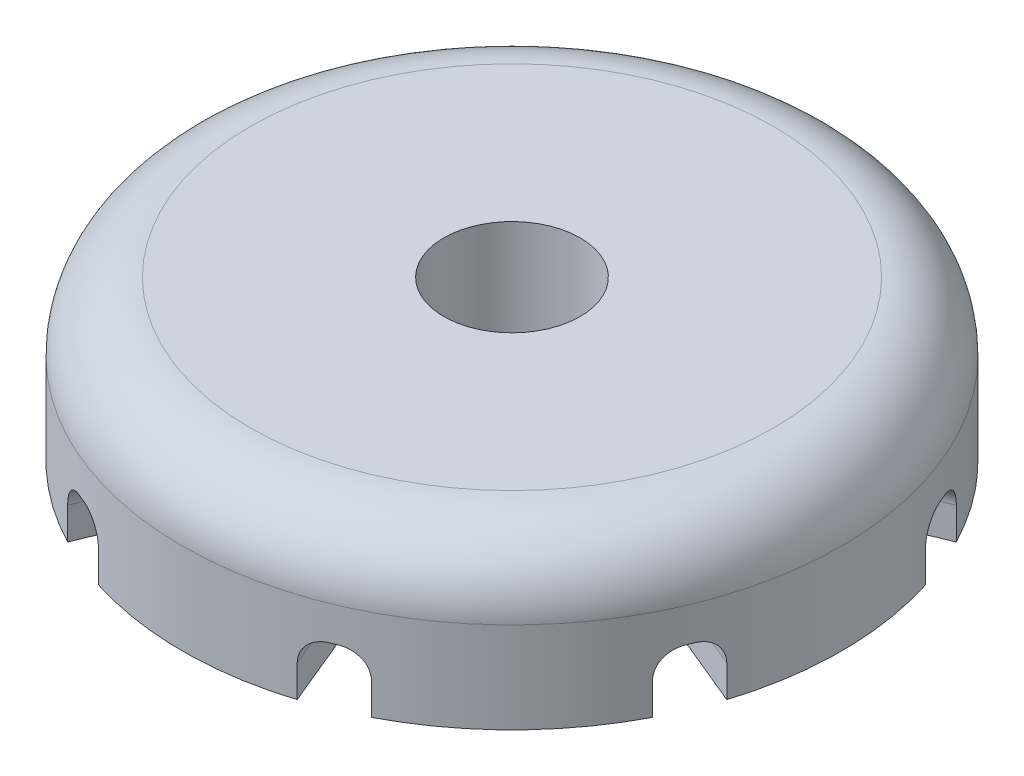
ISO-10303-21;
HEADER;
FILE_DESCRIPTION(('STEP AP214'),'2;1');
FILE_NAME('part.step','',(''),(''),'','','');
FILE_SCHEMA(('AUTOMOTIVE_DESIGN { 1 0 10303 214 1 1 1 1 }'));
ENDSEC;
DATA;
#1=APPLICATION_CONTEXT('core data for automotive mechanical design processes');
#2=APPLICATION_PROTOCOL_DEFINITION('international standard','automotive_design',2000,#1);
#3=PRODUCT_CONTEXT('',#1,'mechanical');
#4=PRODUCT('Part','Part','',(#3));
#5=PRODUCT_RELATED_PRODUCT_CATEGORY('part','',(#4));
#6=PRODUCT_DEFINITION_FORMATION('','',#4);
#7=PRODUCT_DEFINITION_CONTEXT('part definition',#1,'design');
#8=PRODUCT_DEFINITION('design','',#6,#7);
#9=PRODUCT_DEFINITION_SHAPE('','',#8);
#10=(LENGTH_UNIT() NAMED_UNIT(*) SI_UNIT(.MILLI.,.METRE.));
#11=(NAMED_UNIT(*) PLANE_ANGLE_UNIT() SI_UNIT($,.RADIAN.));
#12=(NAMED_UNIT(*) SI_UNIT($,.STERADIAN.) SOLID_ANGLE_UNIT());
#13=UNCERTAINTY_MEASURE_WITH_UNIT(LENGTH_MEASURE(1.E-05),#10,'distance_accuracy_value','');
#14=(GEOMETRIC_REPRESENTATION_CONTEXT(3) GLOBAL_UNCERTAINTY_ASSIGNED_CONTEXT((#13)) GLOBAL_UNIT_ASSIGNED_CONTEXT((#10,
#11,#12)) REPRESENTATION_CONTEXT('',''));
#15=CARTESIAN_POINT('',(0.,0.,0.));
#16=DIRECTION('',(0.,0.,1.));
#17=DIRECTION('',(1.,0.,0.));
#18=AXIS2_PLACEMENT_3D('',#15,#16,#17);
#19=CARTESIAN_POINT('',(0.,0.,0.));
#20=DIRECTION('',(0.,1.,0.));
#21=DIRECTION('',(0.,0.,1.));
#22=AXIS2_PLACEMENT_3D('',#19,#20,#21);
#23=PLANE('',#22);
#24=CARTESIAN_POINT('',(2.67878402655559,0.,6.46715672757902));
#25=DIRECTION('',(0.,-1.,0.));
#26=DIRECTION('',(0.,0.,-1.));
#27=AXIS2_PLACEMENT_3D('',#24,#25,#26);
#28=CIRCLE('',#27,1.2500000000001);
#29=CARTESIAN_POINT('',(1.52393461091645,0.,6.9455110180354));
#30=VERTEX_POINT('',#29);
#31=CARTESIAN_POINT('',(3.83363344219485,0.,5.9888024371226));
#32=VERTEX_POINT('',#31);
#33=EDGE_CURVE('E379',#30,#32,#28,.T.);
#34=ORIENTED_EDGE('',*,*,#33,.F.);
#35=DIRECTION('',(-0.382683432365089,0.,-0.923879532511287));
#36=VECTOR('',#35,1.);
#37=CARTESIAN_POINT('',(1.52393461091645,0.,6.9455110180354));
#38=LINE('',#37,#36);
#39=CARTESIAN_POINT('',(4.37340318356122,0.,13.8247366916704));
#40=VERTEX_POINT('',#39);
#41=EDGE_CURVE('E376',#40,#30,#38,.T.);
#42=ORIENTED_EDGE('',*,*,#41,.F.);
#43=CARTESIAN_POINT('',(0.,0.,0.));
#44=DIRECTION('',(0.,1.,0.));
#45=DIRECTION('',(0.,0.,1.));
#46=AXIS2_PLACEMENT_3D('',#43,#44,#45);
#47=CIRCLE('',#46,14.5);
#48=CARTESIAN_POINT('',(-4.37340318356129,0.,13.8247366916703));
#49=VERTEX_POINT('',#48);
#50=EDGE_CURVE('E1101',#49,#40,#47,.T.);
#51=ORIENTED_EDGE('',*,*,#50,.F.);
#52=DIRECTION('',(-0.38268343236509,0.,0.923879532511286));
#53=VECTOR('',#52,1.);
#54=CARTESIAN_POINT('',(-1.5239346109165,0.,6.94551101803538));
#55=LINE('',#54,#53);
#56=CARTESIAN_POINT('',(-1.5239346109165,0.,6.94551101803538));
#57=VERTEX_POINT('',#56);
#58=EDGE_CURVE('E398',#57,#49,#55,.T.);
#59=ORIENTED_EDGE('',*,*,#58,.F.);
#60=CARTESIAN_POINT('',(-2.67878402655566,0.,6.46715672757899));
#61=DIRECTION('',(0.,-1.,0.));
#62=DIRECTION('',(0.,0.,-1.));
#63=AXIS2_PLACEMENT_3D('',#60,#61,#62);
#64=CIRCLE('',#63,1.25000000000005);
#65=CARTESIAN_POINT('',(-3.83363344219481,0.,5.98880243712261));
#66=VERTEX_POINT('',#65);
#67=EDGE_CURVE('E394',#66,#57,#64,.T.);
#68=ORIENTED_EDGE('',*,*,#67,.F.);
#69=DIRECTION('',(0.382683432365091,0.,-0.923879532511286));
#70=VECTOR('',#69,1.);
#71=CARTESIAN_POINT('',(-3.83363344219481,0.,5.98880243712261));
#72=LINE('',#71,#70);
#73=CARTESIAN_POINT('',(-6.68310201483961,0.,12.8680281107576));
#74=VERTEX_POINT('',#73);
#75=EDGE_CURVE('E401',#74,#66,#72,.T.);
#76=ORIENTED_EDGE('',*,*,#75,.F.);
#77=CARTESIAN_POINT('',(-12.8680281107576,0.,6.68310201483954));
#78=VERTEX_POINT('',#77);
#79=EDGE_CURVE('E1103',#78,#74,#47,.T.);
#80=ORIENTED_EDGE('',*,*,#79,.F.);
#81=DIRECTION('',(-0.923879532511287,0.,0.382683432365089));
#82=VECTOR('',#81,1.);
#83=CARTESIAN_POINT('',(-5.98880243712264,0.,3.83363344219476));
#84=LINE('',#83,#82);
#85=CARTESIAN_POINT('',(-5.98880243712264,0.,3.83363344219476));
#86=VERTEX_POINT('',#85);
#87=EDGE_CURVE('E411',#86,#78,#84,.T.);
#88=ORIENTED_EDGE('',*,*,#87,.F.);
#89=CARTESIAN_POINT('',(-6.46715672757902,0.,2.67878402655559));
#90=DIRECTION('',(0.,-1.,0.));
#91=DIRECTION('',(0.,0.,-1.));
#92=AXIS2_PLACEMENT_3D('',#89,#90,#91);
#93=CIRCLE('',#92,1.25000000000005);
#94=CARTESIAN_POINT('',(-6.9455110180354,0.,1.52393461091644));
#95=VERTEX_POINT('',#94);
#96=EDGE_CURVE('E407',#95,#86,#93,.T.);
#97=ORIENTED_EDGE('',*,*,#96,.F.);
#98=DIRECTION('',(0.923879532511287,0.,-0.382683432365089));
#99=VECTOR('',#98,1.);
#100=CARTESIAN_POINT('',(-6.9455110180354,0.,1.52393461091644));
#101=LINE('',#100,#99);
#102=CARTESIAN_POINT('',(-13.8247366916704,0.,4.37340318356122));
#103=VERTEX_POINT('',#102);
#104=EDGE_CURVE('E414',#103,#95,#101,.T.);
#105=ORIENTED_EDGE('',*,*,#104,.F.);
#106=CARTESIAN_POINT('',(-13.8247366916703,0.,-4.3734031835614));
#107=VERTEX_POINT('',#106);
#108=EDGE_CURVE('E1105',#107,#103,#47,.T.);
#109=ORIENTED_EDGE('',*,*,#108,.F.);
#110=DIRECTION('',(-0.923879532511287,0.,-0.382683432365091));
#111=VECTOR('',#110,1.);
#112=CARTESIAN_POINT('',(-6.94551101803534,0.,-1.5239346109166));
#113=LINE('',#112,#111);
#114=CARTESIAN_POINT('',(-6.94551101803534,0.,-1.5239346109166));
#115=VERTEX_POINT('',#114);
#116=EDGE_CURVE('E424',#115,#107,#113,.T.);
#117=ORIENTED_EDGE('',*,*,#116,.F.);
#118=CARTESIAN_POINT('',(-6.467156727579,0.,-2.67878402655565));
#119=DIRECTION('',(0.,-1.,0.));
#120=DIRECTION('',(0.,0.,-1.));
#121=AXIS2_PLACEMENT_3D('',#118,#119,#120);
#122=CIRCLE('',#121,1.25);
#123=CARTESIAN_POINT('',(-5.98880243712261,0.,-3.83363344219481));
#124=VERTEX_POINT('',#123);
#125=EDGE_CURVE('E420',#124,#115,#122,.T.);
#126=ORIENTED_EDGE('',*,*,#125,.F.);
#127=DIRECTION('',(0.923879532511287,0.,0.38268343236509));
#128=VECTOR('',#127,1.);
#129=CARTESIAN_POINT('',(-5.98880243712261,0.,-3.83363344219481));
#130=LINE('',#129,#128);
#131=CARTESIAN_POINT('',(-12.8680281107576,0.,-6.6831020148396));
#132=VERTEX_POINT('',#131);
#133=EDGE_CURVE('E427',#132,#124,#130,.T.);
#134=ORIENTED_EDGE('',*,*,#133,.F.);
#135=CARTESIAN_POINT('',(-6.68310201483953,0.,-12.8680281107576));
#136=VERTEX_POINT('',#135);
#137=EDGE_CURVE('E1138',#136,#132,#47,.T.);
#138=ORIENTED_EDGE('',*,*,#137,.F.);
#139=DIRECTION('',(-0.382683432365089,0.,-0.923879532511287));
#140=VECTOR('',#139,1.);
#141=CARTESIAN_POINT('',(-3.83363344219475,0.,-5.98880243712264));
#142=LINE('',#141,#140);
#143=CARTESIAN_POINT('',(-3.83363344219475,0.,-5.98880243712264));
#144=VERTEX_POINT('',#143);
#145=EDGE_CURVE('E437',#144,#136,#142,.T.);
#146=ORIENTED_EDGE('',*,*,#145,.F.);
#147=CARTESIAN_POINT('',(-2.67878402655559,0.,-6.46715672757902));
#148=DIRECTION('',(0.,-1.,0.));
#149=DIRECTION('',(0.,0.,-1.));
#150=AXIS2_PLACEMENT_3D('',#147,#148,#149);
#151=CIRCLE('',#150,1.25000000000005);
#152=CARTESIAN_POINT('',(-1.52393461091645,0.,-6.9455110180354));
#153=VERTEX_POINT('',#152);
#154=EDGE_CURVE('E433',#153,#144,#151,.T.);
#155=ORIENTED_EDGE('',*,*,#154,.F.);
#156=DIRECTION('',(0.382683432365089,0.,0.923879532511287));
#157=VECTOR('',#156,1.);
#158=CARTESIAN_POINT('',(-1.52393461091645,0.,-6.9455110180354));
#159=LINE('',#158,#157);
#160=CARTESIAN_POINT('',(-4.37340318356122,0.,-13.8247366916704));
#161=VERTEX_POINT('',#160);
#162=EDGE_CURVE('E440',#161,#153,#159,.T.);
#163=ORIENTED_EDGE('',*,*,#162,.F.);
#164=CARTESIAN_POINT('',(4.3734031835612,0.,-13.8247366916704));
#165=VERTEX_POINT('',#164);
#166=EDGE_CURVE('E1136',#165,#161,#47,.T.);
#167=ORIENTED_EDGE('',*,*,#166,.F.);
#168=DIRECTION('',(0.382683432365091,0.,-0.923879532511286));
#169=VECTOR('',#168,1.);
#170=CARTESIAN_POINT('',(1.52393461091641,0.,-6.94551101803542));
#171=LINE('',#170,#169);
#172=CARTESIAN_POINT('',(1.52393461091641,0.,-6.94551101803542));
#173=VERTEX_POINT('',#172);
#174=EDGE_CURVE('E450',#173,#165,#171,.T.);
#175=ORIENTED_EDGE('',*,*,#174,.F.);
#176=CARTESIAN_POINT('',(2.67878402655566,0.,-6.46715672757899));
#177=DIRECTION('',(0.,-1.,0.));
#178=DIRECTION('',(0.,0.,-1.));
#179=AXIS2_PLACEMENT_3D('',#176,#177,#178);
#180=CIRCLE('',#179,1.2500000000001);
#181=CARTESIAN_POINT('',(3.83363344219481,0.,-5.98880243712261));
#182=VERTEX_POINT('',#181);
#183=EDGE_CURVE('E446',#182,#173,#180,.T.);
#184=ORIENTED_EDGE('',*,*,#183,.F.);
#185=DIRECTION('',(-0.38268343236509,0.,0.923879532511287));
#186=VECTOR('',#185,1.);
#187=CARTESIAN_POINT('',(3.83363344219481,0.,-5.98880243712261));
#188=LINE('',#187,#186);
#189=CARTESIAN_POINT('',(6.68310201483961,0.,-12.8680281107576));
#190=VERTEX_POINT('',#189);
#191=EDGE_CURVE('E453',#190,#182,#188,.T.);
#192=ORIENTED_EDGE('',*,*,#191,.F.);
#193=CARTESIAN_POINT('',(12.8680281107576,0.,-6.68310201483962));
#194=VERTEX_POINT('',#193);
#195=EDGE_CURVE('E523',#194,#190,#47,.T.);
#196=ORIENTED_EDGE('',*,*,#195,.F.);
#197=DIRECTION('',(0.923879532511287,0.,-0.382683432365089));
#198=VECTOR('',#197,1.);
#199=CARTESIAN_POINT('',(5.9888024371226,0.,-3.83363344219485));
#200=LINE('',#199,#198);
#201=CARTESIAN_POINT('',(5.9888024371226,0.,-3.83363344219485));
#202=VERTEX_POINT('',#201);
#203=EDGE_CURVE('E463',#202,#194,#200,.T.);
#204=ORIENTED_EDGE('',*,*,#203,.F.);
#205=CARTESIAN_POINT('',(6.46715672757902,0.,-2.67878402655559));
#206=DIRECTION('',(0.,-1.,0.));
#207=DIRECTION('',(0.,0.,-1.));
#208=AXIS2_PLACEMENT_3D('',#205,#206,#207);
#209=CIRCLE('',#208,1.2500000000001);
#210=CARTESIAN_POINT('',(6.9455110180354,0.,-1.52393461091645));
#211=VERTEX_POINT('',#210);
#212=EDGE_CURVE('E459',#211,#202,#209,.T.);
#213=ORIENTED_EDGE('',*,*,#212,.F.);
#214=DIRECTION('',(-0.923879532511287,0.,0.382683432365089));
#215=VECTOR('',#214,1.);
#216=CARTESIAN_POINT('',(6.9455110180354,0.,-1.52393461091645));
#217=LINE('',#216,#215);
#218=CARTESIAN_POINT('',(13.8247366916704,0.,-4.37340318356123));
#219=VERTEX_POINT('',#218);
#220=EDGE_CURVE('E466',#219,#211,#217,.T.);
#221=ORIENTED_EDGE('',*,*,#220,.F.);
#222=CARTESIAN_POINT('',(13.8247366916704,0.,4.37340318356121));
#223=VERTEX_POINT('',#222);
#224=EDGE_CURVE('E519',#223,#219,#47,.T.);
#225=ORIENTED_EDGE('',*,*,#224,.F.);
#226=DIRECTION('',(0.923879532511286,0.,0.382683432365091));
#227=VECTOR('',#226,1.);
#228=CARTESIAN_POINT('',(6.94551101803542,0.,1.52393461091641));
#229=LINE('',#228,#227);
#230=CARTESIAN_POINT('',(6.94551101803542,0.,1.52393461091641));
#231=VERTEX_POINT('',#230);
#232=EDGE_CURVE('E476',#231,#223,#229,.T.);
#233=ORIENTED_EDGE('',*,*,#232,.F.);
#234=CARTESIAN_POINT('',(6.46715672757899,0.,2.67878402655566));
#235=DIRECTION('',(0.,-1.,0.));
#236=DIRECTION('',(0.,0.,-1.));
#237=AXIS2_PLACEMENT_3D('',#234,#235,#236);
#238=CIRCLE('',#237,1.2500000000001);
#239=CARTESIAN_POINT('',(5.98880243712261,0.,3.83363344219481));
#240=VERTEX_POINT('',#239);
#241=EDGE_CURVE('E472',#240,#231,#238,.T.);
#242=ORIENTED_EDGE('',*,*,#241,.F.);
#243=DIRECTION('',(-0.923879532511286,0.,-0.38268343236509));
#244=VECTOR('',#243,1.);
#245=CARTESIAN_POINT('',(5.98880243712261,0.,3.83363344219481));
#246=LINE('',#245,#244);
#247=CARTESIAN_POINT('',(12.8680281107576,0.,6.6831020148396));
#248=VERTEX_POINT('',#247);
#249=EDGE_CURVE('E479',#248,#240,#246,.T.);
#250=ORIENTED_EDGE('',*,*,#249,.F.);
#251=CARTESIAN_POINT('',(6.68310201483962,0.,12.8680281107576));
#252=VERTEX_POINT('',#251);
#253=EDGE_CURVE('E389',#252,#248,#47,.T.);
#254=ORIENTED_EDGE('',*,*,#253,.F.);
#255=DIRECTION('',(0.382683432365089,0.,0.923879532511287));
#256=VECTOR('',#255,1.);
#257=CARTESIAN_POINT('',(3.83363344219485,0.,5.9888024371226));
#258=LINE('',#257,#256);
#259=EDGE_CURVE('E369',#32,#252,#258,.T.);
#260=ORIENTED_EDGE('',*,*,#259,.F.);
#261=EDGE_LOOP('',(#34,#42,#51,#59,#68,#76,#80,#88,#97,#105,#109,#117,#126,#134,#138,#146,#155,
#163,#167,#175,#184,#192,#196,#204,#213,#221,#225,#233,#242,#250,#254,#260));
#262=FACE_BOUND('',#261,.T.);
#263=DIRECTION('',(0.,0.,1.));
#264=VECTOR('',#263,1.);
#265=CARTESIAN_POINT('',(3.5,0.,3.5));
#266=LINE('',#265,#264);
#267=CARTESIAN_POINT('',(3.5,0.,-3.5));
#268=VERTEX_POINT('',#267);
#269=CARTESIAN_POINT('',(3.5,0.,3.5));
#270=VERTEX_POINT('',#269);
#271=EDGE_CURVE('E485',#268,#270,#266,.T.);
#272=ORIENTED_EDGE('',*,*,#271,.F.);
#273=DIRECTION('',(1.,0.,0.));
#274=VECTOR('',#273,1.);
#275=CARTESIAN_POINT('',(-3.5,0.,-3.5));
#276=LINE('',#275,#274);
#277=CARTESIAN_POINT('',(-3.5,0.,-3.5));
#278=VERTEX_POINT('',#277);
#279=EDGE_CURVE('E491',#278,#268,#276,.T.);
#280=ORIENTED_EDGE('',*,*,#279,.F.);
#281=DIRECTION('',(0.,0.,-1.));
#282=VECTOR('',#281,1.);
#283=CARTESIAN_POINT('',(-3.5,0.,3.5));
#284=LINE('',#283,#282);
#285=CARTESIAN_POINT('',(-3.5,0.,3.5));
#286=VERTEX_POINT('',#285);
#287=EDGE_CURVE('E503',#286,#278,#284,.T.);
#288=ORIENTED_EDGE('',*,*,#287,.F.);
#289=DIRECTION('',(-1.,0.,0.));
#290=VECTOR('',#289,1.);
#291=CARTESIAN_POINT('',(-3.5,0.,3.5));
#292=LINE('',#291,#290);
#293=EDGE_CURVE('E500',#270,#286,#292,.T.);
#294=ORIENTED_EDGE('',*,*,#293,.F.);
#295=EDGE_LOOP('',(#272,#280,#288,#294));
#296=FACE_BOUND('',#295,.T.);
#297=ADVANCED_FACE('F34',(#262,#296),#23,.F.);
#298=CARTESIAN_POINT('',(0.,7.,0.));
#299=DIRECTION('',(0.,-1.,0.));
#300=DIRECTION('',(0.,0.,-1.));
#301=AXIS2_PLACEMENT_3D('',#298,#299,#300);
#302=CYLINDRICAL_SURFACE('',#301,14.5);
#303=CARTESIAN_POINT('',(0.,4.,0.));
#304=DIRECTION('',(0.,1.,0.));
#305=DIRECTION('',(0.,0.,1.));
#306=AXIS2_PLACEMENT_3D('',#303,#304,#305);
#307=CIRCLE('',#306,14.5);
#308=CARTESIAN_POINT('',(0.,4.,14.5));
#309=VERTEX_POINT('',#308);
#310=EDGE_CURVE('E11',#309,#309,#307,.F.);
#311=ORIENTED_EDGE('',*,*,#310,.T.);
#312=EDGE_LOOP('',(#311));
#313=FACE_BOUND('',#312,.T.);
#314=ORIENTED_EDGE('',*,*,#50,.T.);
#315=DIRECTION('',(0.,-1.,0.));
#316=VECTOR('',#315,1.);
#317=CARTESIAN_POINT('',(4.37340318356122,7.,13.8247366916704));
#318=LINE('',#317,#316);
#319=CARTESIAN_POINT('',(4.37340318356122,1.4,13.8247366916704));
#320=VERTEX_POINT('',#319);
#321=EDGE_CURVE('E584',#40,#320,#318,.F.);
#322=ORIENTED_EDGE('',*,*,#321,.T.);
#323=CARTESIAN_POINT('',(4.37340318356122,1.4,13.8247366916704));
#324=CARTESIAN_POINT('',(4.37340309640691,1.4308846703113,13.8247361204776));
#325=CARTESIAN_POINT('',(4.37464877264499,1.46175449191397,13.8243427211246));
#326=CARTESIAN_POINT('',(4.37961642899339,1.52327215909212,13.8227699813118));
#327=CARTESIAN_POINT('',(4.38333825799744,1.55392001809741,13.8215906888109));
#328=CARTESIAN_POINT('',(4.3981775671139,1.64513848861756,13.8168791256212));
#329=CARTESIAN_POINT('',(4.41296899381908,1.70509639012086,13.812173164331));
#330=CARTESIAN_POINT('',(4.45189413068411,1.82155127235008,13.7996757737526));
#331=CARTESIAN_POINT('',(4.47603174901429,1.8780467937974,13.791883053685));
#332=CARTESIAN_POINT('',(4.53290030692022,1.98599326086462,13.7732968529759));
#333=CARTESIAN_POINT('',(4.56563019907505,2.0374448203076,13.762503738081));
#334=CARTESIAN_POINT('',(4.63877042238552,2.13396984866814,13.7380236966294));
#335=CARTESIAN_POINT('',(4.67919794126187,2.17902864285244,13.7243302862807));
#336=CARTESIAN_POINT('',(4.76648003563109,2.2613754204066,13.6942613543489));
#337=CARTESIAN_POINT('',(4.81333588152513,2.29866186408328,13.6778853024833));
#338=CARTESIAN_POINT('',(4.91217781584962,2.36446947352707,13.6427000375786));
#339=CARTESIAN_POINT('',(4.96417467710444,2.39297169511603,13.6238856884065));
#340=CARTESIAN_POINT('',(5.0716732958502,2.44027553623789,13.5842336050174));
#341=CARTESIAN_POINT('',(5.12717291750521,2.45908300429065,13.5633970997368));
#342=CARTESIAN_POINT('',(5.22085225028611,2.48182017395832,13.5275384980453));
#343=CARTESIAN_POINT('',(5.25852037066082,2.48863258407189,13.5129419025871));
#344=CARTESIAN_POINT('',(5.33415258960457,2.49772222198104,13.4832667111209));
#345=CARTESIAN_POINT('',(5.37211621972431,2.50000556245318,13.4681887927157));
#346=CARTESIAN_POINT('',(5.41003092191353,2.5,13.4529389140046));
#347=B_SPLINE_CURVE_WITH_KNOTS('',3,(#323,#324,#325,#326,#327,#328,#329,#330,#331,#332,#333,
#334,#335,#336,#337,#338,#339,#340,#341,#342,#343,#344,#345,#346),.UNSPECIFIED.,.F.,.F.,(4,2,2,
2,2,2,2,2,2,2,2,4),(0.,0.0925969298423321,0.185188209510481,0.370037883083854,0.554964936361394,
0.739869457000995,0.92519179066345,1.11055080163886,1.29630680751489,1.48195062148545,
1.60461579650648,1.7271153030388),.UNSPECIFIED.);
#348=CARTESIAN_POINT('',(5.41003092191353,2.5,13.4529389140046));
#349=VERTEX_POINT('',#348);
#350=EDGE_CURVE('E689',#320,#349,#347,.T.);
#351=ORIENTED_EDGE('',*,*,#350,.T.);
#352=CARTESIAN_POINT('',(0.,2.5,0.));
#353=DIRECTION('',(0.,-1.,0.));
#354=DIRECTION('',(0.,0.,-1.));
#355=AXIS2_PLACEMENT_3D('',#352,#353,#354);
#356=CIRCLE('',#355,14.5);
#357=CARTESIAN_POINT('',(5.6871947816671,2.5,13.338133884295));
#358=VERTEX_POINT('',#357);
#359=EDGE_CURVE('E579',#358,#349,#356,.T.);
#360=ORIENTED_EDGE('',*,*,#359,.F.);
#361=CARTESIAN_POINT('',(5.6871947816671,2.5,13.338133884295));
#362=CARTESIAN_POINT('',(5.71563698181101,2.4999998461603,13.3260071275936));
#363=CARTESIAN_POINT('',(5.74402620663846,2.49869566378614,13.3137941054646));
#364=CARTESIAN_POINT('',(5.80052396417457,2.49349361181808,13.2892764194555));
#365=CARTESIAN_POINT('',(5.82863251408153,2.48959590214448,13.2769717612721));
#366=CARTESIAN_POINT('',(5.91218130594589,2.47405221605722,13.2400831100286));
#367=CARTESIAN_POINT('',(5.96694692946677,2.45855556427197,13.2154808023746));
#368=CARTESIAN_POINT('',(6.07304681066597,2.41773291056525,13.1670617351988));
#369=CARTESIAN_POINT('',(6.12437963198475,2.39240282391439,13.1432453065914));
#370=CARTESIAN_POINT('',(6.22223238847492,2.33263780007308,13.0972038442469));
#371=CARTESIAN_POINT('',(6.2687529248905,2.29820400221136,13.0749786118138));
#372=CARTESIAN_POINT('',(6.3558335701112,2.22112473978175,13.032871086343));
#373=CARTESIAN_POINT('',(6.39638139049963,2.17846275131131,13.0129936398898));
#374=CARTESIAN_POINT('',(6.4703476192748,2.08616252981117,12.9763750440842));
#375=CARTESIAN_POINT('',(6.50376465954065,2.03652296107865,12.9596344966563));
#376=CARTESIAN_POINT('',(6.56261575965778,1.93162135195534,12.9299329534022));
#377=CARTESIAN_POINT('',(6.58804116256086,1.87635329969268,12.9169760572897));
#378=CARTESIAN_POINT('',(6.63018248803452,1.7618127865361,12.8953962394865));
#379=CARTESIAN_POINT('',(6.64690374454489,1.70254280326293,12.8867706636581));
#380=CARTESIAN_POINT('',(6.66704934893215,1.6024246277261,12.8763556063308));
#381=CARTESIAN_POINT('',(6.6730657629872,1.56221231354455,12.8732369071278));
#382=CARTESIAN_POINT('',(6.68109142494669,1.48133910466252,12.8690723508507));
#383=CARTESIAN_POINT('',(6.68310610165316,1.44067889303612,12.8680236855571));
#384=CARTESIAN_POINT('',(6.68310201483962,1.4,12.8680281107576));
#385=B_SPLINE_CURVE_WITH_KNOTS('',3,(#361,#362,#363,#364,#365,#366,#367,#368,#369,#370,#371,
#372,#373,#374,#375,#376,#377,#378,#379,#380,#381,#382,#383,#384),.UNSPECIFIED.,.F.,.F.,(4,2,2,
2,2,2,2,2,2,2,2,4),(0.,0.0927013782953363,0.185397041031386,0.370459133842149,0.555598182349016,
0.740714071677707,0.926205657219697,1.11173279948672,1.29746022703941,1.48307370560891,
1.6051765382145,1.72711361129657),.UNSPECIFIED.);
#386=CARTESIAN_POINT('',(6.68310201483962,1.4,12.8680281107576));
#387=VERTEX_POINT('',#386);
#388=EDGE_CURVE('E696',#358,#387,#385,.T.);
#389=ORIENTED_EDGE('',*,*,#388,.T.);
#390=DIRECTION('',(0.,-1.,0.));
#391=VECTOR('',#390,1.);
#392=CARTESIAN_POINT('',(6.68310201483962,7.,12.8680281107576));
#393=LINE('',#392,#391);
#394=EDGE_CURVE('E582',#387,#252,#393,.T.);
#395=ORIENTED_EDGE('',*,*,#394,.T.);
#396=ORIENTED_EDGE('',*,*,#253,.T.);
#397=DIRECTION('',(0.,-1.,0.));
#398=VECTOR('',#397,1.);
#399=CARTESIAN_POINT('',(12.8680281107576,7.,6.6831020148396));
#400=LINE('',#399,#398);
#401=CARTESIAN_POINT('',(12.8680281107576,1.4,6.6831020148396));
#402=VERTEX_POINT('',#401);
#403=EDGE_CURVE('E528',#248,#402,#400,.F.);
#404=ORIENTED_EDGE('',*,*,#403,.T.);
#405=CARTESIAN_POINT('',(12.8680281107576,1.4,6.6831020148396));
#406=CARTESIAN_POINT('',(12.8680276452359,1.4308846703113,6.68310167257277));
#407=CARTESIAN_POINT('',(12.8686302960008,1.46175449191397,6.68194267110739));
#408=CARTESIAN_POINT('',(12.8710308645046,1.52327215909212,6.67731791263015));
#409=CARTESIAN_POINT('',(12.8728287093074,1.55392001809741,6.67385229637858));
#410=CARTESIAN_POINT('',(12.8799901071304,1.64513848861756,6.66002774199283));
#411=CARTESIAN_POINT('',(12.8871216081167,1.70509639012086,6.64624100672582));
#412=CARTESIAN_POINT('',(12.9058088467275,1.82155127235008,6.60987978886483));
#413=CARTESIAN_POINT('',(12.9173664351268,1.8780467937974,6.58730163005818));
#414=CARTESIAN_POINT('',(12.9444361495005,1.98599326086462,6.53394705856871));
#415=CARTESIAN_POINT('',(12.9599477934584,2.0374448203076,6.50317164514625));
#416=CARTESIAN_POINT('',(12.9943557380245,2.13396984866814,6.43414369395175));
#417=CARTESIAN_POINT('',(13.0132596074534,2.17902864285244,6.39587441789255));
#418=CARTESIAN_POINT('',(13.0537154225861,2.2613754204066,6.31289471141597));
#419=CARTESIAN_POINT('',(13.0752678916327,2.29866186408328,6.26818300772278));
#420=CARTESIAN_POINT('',(13.1202799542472,2.36446947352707,6.17341146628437));
#421=CARTESIAN_POINT('',(13.1437435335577,2.39297169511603,6.12334037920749));
#422=CARTESIAN_POINT('',(13.1917182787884,2.44027553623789,6.0192891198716));
#423=CARTESIAN_POINT('',(13.2162288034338,2.45908300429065,5.96531132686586));
#424=CARTESIAN_POINT('',(13.2571142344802,2.48182017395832,5.87371417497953));
#425=CARTESIAN_POINT('',(13.273428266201,2.48863258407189,5.8367574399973));
#426=CARTESIAN_POINT('',(13.3059247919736,2.49772222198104,5.76229385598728));
#427=CARTESIAN_POINT('',(13.3221074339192,2.50000556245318,5.72478781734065));
#428=CARTESIAN_POINT('',(13.338133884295,2.5,5.68719478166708));
#429=B_SPLINE_CURVE_WITH_KNOTS('',3,(#405,#406,#407,#408,#409,#410,#411,#412,#413,#414,#415,
#416,#417,#418,#419,#420,#421,#422,#423,#424,#425,#426,#427,#428),.UNSPECIFIED.,.F.,.F.,(4,2,2,
2,2,2,2,2,2,2,2,4),(0.,0.0925969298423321,0.185188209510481,0.370037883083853,0.554964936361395,
0.739869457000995,0.925191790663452,1.11055080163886,1.29630680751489,1.48195062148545,
1.60461579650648,1.7271153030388),.UNSPECIFIED.);
#430=CARTESIAN_POINT('',(13.338133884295,2.5,5.68719478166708));
#431=VERTEX_POINT('',#430);
#432=EDGE_CURVE('E856',#402,#431,#429,.T.);
#433=ORIENTED_EDGE('',*,*,#432,.T.);
#434=CARTESIAN_POINT('',(0.,2.5,0.));
#435=DIRECTION('',(0.,-1.,0.));
#436=DIRECTION('',(0.,0.,-1.));
#437=AXIS2_PLACEMENT_3D('',#434,#435,#436);
#438=CIRCLE('',#437,14.5);
#439=CARTESIAN_POINT('',(13.4529389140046,2.5,5.41003092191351));
#440=VERTEX_POINT('',#439);
#441=EDGE_CURVE('E522',#440,#431,#438,.T.);
#442=ORIENTED_EDGE('',*,*,#441,.F.);
#443=CARTESIAN_POINT('',(13.4529389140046,2.5,5.41003092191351));
#444=CARTESIAN_POINT('',(13.4644756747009,2.4999998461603,5.38134433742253));
#445=CARTESIAN_POINT('',(13.4759139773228,2.49869566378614,5.35263421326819));
#446=CARTESIAN_POINT('',(13.4985273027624,2.49349361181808,5.29534764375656));
#447=CARTESIAN_POINT('',(13.5097023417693,2.48959590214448,5.26677119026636));
#448=CARTESIAN_POINT('',(13.5426960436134,2.47405221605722,5.18160905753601));
#449=CARTESIAN_POINT('',(13.5640247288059,2.45855556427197,5.12548745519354));
#450=CARTESIAN_POINT('',(13.6048112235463,2.41773291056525,5.01622605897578));
#451=CARTESIAN_POINT('',(13.6242682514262,2.39240282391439,4.96308751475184));
#452=CARTESIAN_POINT('',(13.6609043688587,2.33263780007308,4.8613389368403));
#453=CARTESIAN_POINT('',(13.6780837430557,2.29820400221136,4.81272833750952));
#454=CARTESIAN_POINT('',(13.7098845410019,2.22112473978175,4.72137850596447));
#455=CARTESIAN_POINT('',(13.7245007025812,2.17846275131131,4.67865139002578));
#456=CARTESIAN_POINT('',(13.7509094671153,2.08616252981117,4.60045611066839));
#457=CARTESIAN_POINT('',(13.7627015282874,2.03652296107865,4.56498934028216));
#458=CARTESIAN_POINT('',(13.7833133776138,1.93162135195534,4.50237316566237));
#459=CARTESIAN_POINT('',(13.7921299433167,1.87635329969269,4.47523278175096));
#460=CARTESIAN_POINT('',(13.8066691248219,1.7618127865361,4.43017512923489));
#461=CARTESIAN_POINT('',(13.8123936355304,1.70254280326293,4.41225221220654));
#462=CARTESIAN_POINT('',(13.8192741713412,1.6024246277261,4.39064256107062));
#463=CARTESIAN_POINT('',(13.821323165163,1.56221231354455,4.38418306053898));
#464=CARTESIAN_POINT('',(13.8240533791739,1.48133910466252,4.37556327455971));
#465=CARTESIAN_POINT('',(13.8247364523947,1.44067889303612,4.3733971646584));
#466=CARTESIAN_POINT('',(13.8247366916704,1.4,4.37340318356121));
#467=B_SPLINE_CURVE_WITH_KNOTS('',3,(#443,#444,#445,#446,#447,#448,#449,#450,#451,#452,#453,
#454,#455,#456,#457,#458,#459,#460,#461,#462,#463,#464,#465,#466),.UNSPECIFIED.,.F.,.F.,(4,2,2,
2,2,2,2,2,2,2,2,4),(0.,0.0927013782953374,0.185397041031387,0.370459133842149,0.555598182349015,
0.740714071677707,0.926205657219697,1.11173279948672,1.29746022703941,1.48307370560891,
1.6051765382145,1.72711361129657),.UNSPECIFIED.);
#468=CARTESIAN_POINT('',(13.8247366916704,1.4,4.37340318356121));
#469=VERTEX_POINT('',#468);
#470=EDGE_CURVE('E49',#440,#469,#467,.T.);
#471=ORIENTED_EDGE('',*,*,#470,.T.);
#472=DIRECTION('',(0.,-1.,0.));
#473=VECTOR('',#472,1.);
#474=CARTESIAN_POINT('',(13.8247366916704,7.,4.37340318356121));
#475=LINE('',#474,#473);
#476=EDGE_CURVE('E526',#469,#223,#475,.T.);
#477=ORIENTED_EDGE('',*,*,#476,.T.);
#478=ORIENTED_EDGE('',*,*,#224,.T.);
#479=DIRECTION('',(0.,-1.,0.));
#480=VECTOR('',#479,1.);
#481=CARTESIAN_POINT('',(13.8247366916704,7.,-4.37340318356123));
#482=LINE('',#481,#480);
#483=CARTESIAN_POINT('',(13.8247366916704,1.4,-4.37340318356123));
#484=VERTEX_POINT('',#483);
#485=EDGE_CURVE('E536',#219,#484,#482,.F.);
#486=ORIENTED_EDGE('',*,*,#485,.T.);
#487=CARTESIAN_POINT('',(13.8247366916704,1.4,-4.37340318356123));
#488=CARTESIAN_POINT('',(13.8247361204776,1.4308846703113,-4.37340309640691));
#489=CARTESIAN_POINT('',(13.8243427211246,1.46175449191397,-4.37464877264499));
#490=CARTESIAN_POINT('',(13.8227699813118,1.52327215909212,-4.37961642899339));
#491=CARTESIAN_POINT('',(13.8215906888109,1.55392001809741,-4.38333825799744));
#492=CARTESIAN_POINT('',(13.8168791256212,1.64513848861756,-4.3981775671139));
#493=CARTESIAN_POINT('',(13.812173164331,1.70509639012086,-4.41296899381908));
#494=CARTESIAN_POINT('',(13.7996757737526,1.82155127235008,-4.45189413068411));
#495=CARTESIAN_POINT('',(13.791883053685,1.8780467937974,-4.47603174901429));
#496=CARTESIAN_POINT('',(13.7732968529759,1.98599326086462,-4.53290030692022));
#497=CARTESIAN_POINT('',(13.762503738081,2.0374448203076,-4.56563019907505));
#498=CARTESIAN_POINT('',(13.7380236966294,2.13396984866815,-4.63877042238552));
#499=CARTESIAN_POINT('',(13.7243302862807,2.17902864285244,-4.67919794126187));
#500=CARTESIAN_POINT('',(13.6942613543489,2.2613754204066,-4.76648003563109));
#501=CARTESIAN_POINT('',(13.6778853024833,2.29866186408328,-4.81333588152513));
#502=CARTESIAN_POINT('',(13.6427000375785,2.36446947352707,-4.91217781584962));
#503=CARTESIAN_POINT('',(13.6238856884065,2.39297169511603,-4.96417467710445));
#504=CARTESIAN_POINT('',(13.5842336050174,2.44027553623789,-5.0716732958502));
#505=CARTESIAN_POINT('',(13.5633970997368,2.45908300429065,-5.12717291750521));
#506=CARTESIAN_POINT('',(13.5275384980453,2.48182017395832,-5.22085225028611));
#507=CARTESIAN_POINT('',(13.5129419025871,2.48863258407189,-5.25852037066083));
#508=CARTESIAN_POINT('',(13.4832667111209,2.49772222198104,-5.33415258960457));
#509=CARTESIAN_POINT('',(13.4681887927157,2.50000556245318,-5.37211621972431));
#510=CARTESIAN_POINT('',(13.4529389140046,2.5,-5.41003092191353));
#511=B_SPLINE_CURVE_WITH_KNOTS('',3,(#487,#488,#489,#490,#491,#492,#493,#494,#495,#496,#497,
#498,#499,#500,#501,#502,#503,#504,#505,#506,#507,#508,#509,#510),.UNSPECIFIED.,.F.,.F.,(4,2,2,
2,2,2,2,2,2,2,2,4),(0.,0.0925969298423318,0.185188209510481,0.370037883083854,0.554964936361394,
0.739869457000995,0.925191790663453,1.11055080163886,1.29630680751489,1.48195062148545,
1.60461579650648,1.7271153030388),.UNSPECIFIED.);
#512=CARTESIAN_POINT('',(13.4529389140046,2.5,-5.41003092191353));
#513=VERTEX_POINT('',#512);
#514=EDGE_CURVE('E823',#484,#513,#511,.T.);
#515=ORIENTED_EDGE('',*,*,#514,.T.);
#516=CARTESIAN_POINT('',(0.,2.5,0.));
#517=DIRECTION('',(0.,-1.,0.));
#518=DIRECTION('',(0.,0.,-1.));
#519=AXIS2_PLACEMENT_3D('',#516,#517,#518);
#520=CIRCLE('',#519,14.5);
#521=CARTESIAN_POINT('',(13.338133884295,2.5,-5.6871947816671));
#522=VERTEX_POINT('',#521);
#523=EDGE_CURVE('E531',#522,#513,#520,.T.);
#524=ORIENTED_EDGE('',*,*,#523,.F.);
#525=CARTESIAN_POINT('',(13.338133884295,2.5,-5.6871947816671));
#526=CARTESIAN_POINT('',(13.3260071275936,2.4999998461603,-5.715636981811));
#527=CARTESIAN_POINT('',(13.3137941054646,2.49869566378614,-5.74402620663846));
#528=CARTESIAN_POINT('',(13.2892764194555,2.49349361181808,-5.80052396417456));
#529=CARTESIAN_POINT('',(13.2769717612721,2.48959590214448,-5.82863251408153));
#530=CARTESIAN_POINT('',(13.2400831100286,2.47405221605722,-5.91218130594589));
#531=CARTESIAN_POINT('',(13.2154808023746,2.45855556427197,-5.96694692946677));
#532=CARTESIAN_POINT('',(13.1670617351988,2.41773291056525,-6.07304681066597));
#533=CARTESIAN_POINT('',(13.1432453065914,2.39240282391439,-6.12437963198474));
#534=CARTESIAN_POINT('',(13.0972038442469,2.33263780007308,-6.22223238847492));
#535=CARTESIAN_POINT('',(13.0749786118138,2.29820400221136,-6.2687529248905));
#536=CARTESIAN_POINT('',(13.032871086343,2.22112473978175,-6.3558335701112));
#537=CARTESIAN_POINT('',(13.0129936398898,2.17846275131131,-6.39638139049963));
#538=CARTESIAN_POINT('',(12.9763750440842,2.08616252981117,-6.4703476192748));
#539=CARTESIAN_POINT('',(12.9596344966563,2.03652296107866,-6.50376465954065));
#540=CARTESIAN_POINT('',(12.9299329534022,1.93162135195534,-6.56261575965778));
#541=CARTESIAN_POINT('',(12.9169760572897,1.87635329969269,-6.58804116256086));
#542=CARTESIAN_POINT('',(12.8953962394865,1.7618127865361,-6.63018248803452));
#543=CARTESIAN_POINT('',(12.8867706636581,1.70254280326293,-6.64690374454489));
#544=CARTESIAN_POINT('',(12.8763556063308,1.6024246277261,-6.66704934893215));
#545=CARTESIAN_POINT('',(12.8732369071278,1.56221231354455,-6.6730657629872));
#546=CARTESIAN_POINT('',(12.8690723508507,1.48133910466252,-6.68109142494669));
#547=CARTESIAN_POINT('',(12.8680236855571,1.44067889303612,-6.68310610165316));
#548=CARTESIAN_POINT('',(12.8680281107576,1.4,-6.68310201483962));
#549=B_SPLINE_CURVE_WITH_KNOTS('',3,(#525,#526,#527,#528,#529,#530,#531,#532,#533,#534,#535,
#536,#537,#538,#539,#540,#541,#542,#543,#544,#545,#546,#547,#548),.UNSPECIFIED.,.F.,.F.,(4,2,2,
2,2,2,2,2,2,2,2,4),(0.,0.0927013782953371,0.185397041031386,0.370459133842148,0.555598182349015,
0.740714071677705,0.926205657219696,1.11173279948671,1.29746022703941,1.48307370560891,
1.6051765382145,1.72711361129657),.UNSPECIFIED.);
#550=CARTESIAN_POINT('',(12.8680281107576,1.4,-6.68310201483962));
#551=VERTEX_POINT('',#550);
#552=EDGE_CURVE('E851',#522,#551,#549,.T.);
#553=ORIENTED_EDGE('',*,*,#552,.T.);
#554=DIRECTION('',(0.,-1.,0.));
#555=VECTOR('',#554,1.);
#556=CARTESIAN_POINT('',(12.8680281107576,7.,-6.68310201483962));
#557=LINE('',#556,#555);
#558=EDGE_CURVE('E534',#551,#194,#557,.T.);
#559=ORIENTED_EDGE('',*,*,#558,.T.);
#560=ORIENTED_EDGE('',*,*,#195,.T.);
#561=DIRECTION('',(0.,-1.,0.));
#562=VECTOR('',#561,1.);
#563=CARTESIAN_POINT('',(6.68310201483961,7.,-12.8680281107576));
#564=LINE('',#563,#562);
#565=CARTESIAN_POINT('',(6.68310201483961,1.4,-12.8680281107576));
#566=VERTEX_POINT('',#565);
#567=EDGE_CURVE('E544',#190,#566,#564,.F.);
#568=ORIENTED_EDGE('',*,*,#567,.T.);
#569=CARTESIAN_POINT('',(6.6831020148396,1.4,-12.8680281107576));
#570=CARTESIAN_POINT('',(6.68310167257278,1.4308846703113,-12.8680276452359));
#571=CARTESIAN_POINT('',(6.68194267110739,1.46175449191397,-12.8686302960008));
#572=CARTESIAN_POINT('',(6.67731791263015,1.52327215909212,-12.8710308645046));
#573=CARTESIAN_POINT('',(6.67385229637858,1.55392001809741,-12.8728287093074));
#574=CARTESIAN_POINT('',(6.66002774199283,1.64513848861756,-12.8799901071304));
#575=CARTESIAN_POINT('',(6.64624100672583,1.70509639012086,-12.8871216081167));
#576=CARTESIAN_POINT('',(6.60987978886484,1.82155127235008,-12.9058088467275));
#577=CARTESIAN_POINT('',(6.58730163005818,1.8780467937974,-12.9173664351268));
#578=CARTESIAN_POINT('',(6.53394705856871,1.98599326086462,-12.9444361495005));
#579=CARTESIAN_POINT('',(6.50317164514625,2.0374448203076,-12.9599477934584));
#580=CARTESIAN_POINT('',(6.43414369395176,2.13396984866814,-12.9943557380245));
#581=CARTESIAN_POINT('',(6.39587441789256,2.17902864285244,-13.0132596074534));
#582=CARTESIAN_POINT('',(6.31289471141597,2.2613754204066,-13.0537154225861));
#583=CARTESIAN_POINT('',(6.26818300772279,2.29866186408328,-13.0752678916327));
#584=CARTESIAN_POINT('',(6.17341146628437,2.36446947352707,-13.1202799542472));
#585=CARTESIAN_POINT('',(6.12334037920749,2.39297169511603,-13.1437435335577));
#586=CARTESIAN_POINT('',(6.0192891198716,2.44027553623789,-13.1917182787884));
#587=CARTESIAN_POINT('',(5.96531132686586,2.45908300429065,-13.2162288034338));
#588=CARTESIAN_POINT('',(5.87371417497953,2.48182017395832,-13.2571142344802));
#589=CARTESIAN_POINT('',(5.8367574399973,2.48863258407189,-13.273428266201));
#590=CARTESIAN_POINT('',(5.76229385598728,2.49772222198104,-13.3059247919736));
#591=CARTESIAN_POINT('',(5.72478781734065,2.50000556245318,-13.3221074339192));
#592=CARTESIAN_POINT('',(5.68719478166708,2.5,-13.338133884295));
#593=B_SPLINE_CURVE_WITH_KNOTS('',3,(#569,#570,#571,#572,#573,#574,#575,#576,#577,#578,#579,
#580,#581,#582,#583,#584,#585,#586,#587,#588,#589,#590,#591,#592),.UNSPECIFIED.,.F.,.F.,(4,2,2,
2,2,2,2,2,2,2,2,4),(0.,0.0925969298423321,0.185188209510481,0.370037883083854,0.554964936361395,
0.739869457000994,0.925191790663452,1.11055080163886,1.29630680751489,1.48195062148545,
1.60461579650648,1.7271153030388),.UNSPECIFIED.);
#594=CARTESIAN_POINT('',(5.68719478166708,2.5,-13.338133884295));
#595=VERTEX_POINT('',#594);
#596=EDGE_CURVE('E812',#566,#595,#593,.T.);
#597=ORIENTED_EDGE('',*,*,#596,.T.);
#598=CARTESIAN_POINT('',(0.,2.5,0.));
#599=DIRECTION('',(0.,-1.,0.));
#600=DIRECTION('',(0.,0.,-1.));
#601=AXIS2_PLACEMENT_3D('',#598,#599,#600);
#602=CIRCLE('',#601,14.5);
#603=CARTESIAN_POINT('',(5.41003092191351,2.5,-13.4529389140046));
#604=VERTEX_POINT('',#603);
#605=EDGE_CURVE('E539',#604,#595,#602,.T.);
#606=ORIENTED_EDGE('',*,*,#605,.F.);
#607=CARTESIAN_POINT('',(5.41003092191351,2.5,-13.4529389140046));
#608=CARTESIAN_POINT('',(5.38134433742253,2.4999998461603,-13.4644756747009));
#609=CARTESIAN_POINT('',(5.35263421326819,2.49869566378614,-13.4759139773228));
#610=CARTESIAN_POINT('',(5.29534764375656,2.49349361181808,-13.4985273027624));
#611=CARTESIAN_POINT('',(5.26677119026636,2.48959590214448,-13.5097023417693));
#612=CARTESIAN_POINT('',(5.18160905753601,2.47405221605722,-13.5426960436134));
#613=CARTESIAN_POINT('',(5.12548745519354,2.45855556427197,-13.5640247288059));
#614=CARTESIAN_POINT('',(5.01622605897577,2.41773291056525,-13.6048112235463));
#615=CARTESIAN_POINT('',(4.96308751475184,2.39240282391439,-13.6242682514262));
#616=CARTESIAN_POINT('',(4.8613389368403,2.33263780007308,-13.6609043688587));
#617=CARTESIAN_POINT('',(4.81272833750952,2.29820400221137,-13.6780837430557));
#618=CARTESIAN_POINT('',(4.72137850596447,2.22112473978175,-13.7098845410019));
#619=CARTESIAN_POINT('',(4.67865139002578,2.17846275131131,-13.7245007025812));
#620=CARTESIAN_POINT('',(4.60045611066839,2.08616252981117,-13.7509094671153));
#621=CARTESIAN_POINT('',(4.56498934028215,2.03652296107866,-13.7627015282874));
#622=CARTESIAN_POINT('',(4.50237316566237,1.93162135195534,-13.7833133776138));
#623=CARTESIAN_POINT('',(4.47523278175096,1.87635329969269,-13.7921299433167));
#624=CARTESIAN_POINT('',(4.43017512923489,1.7618127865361,-13.8066691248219));
#625=CARTESIAN_POINT('',(4.41225221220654,1.70254280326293,-13.8123936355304));
#626=CARTESIAN_POINT('',(4.39064256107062,1.6024246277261,-13.8192741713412));
#627=CARTESIAN_POINT('',(4.38418306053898,1.56221231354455,-13.821323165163));
#628=CARTESIAN_POINT('',(4.37556327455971,1.48133910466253,-13.8240533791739));
#629=CARTESIAN_POINT('',(4.37339716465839,1.44067889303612,-13.8247364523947));
#630=CARTESIAN_POINT('',(4.3734031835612,1.4,-13.8247366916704));
#631=B_SPLINE_CURVE_WITH_KNOTS('',3,(#607,#608,#609,#610,#611,#612,#613,#614,#615,#616,#617,
#618,#619,#620,#621,#622,#623,#624,#625,#626,#627,#628,#629,#630),.UNSPECIFIED.,.F.,.F.,(4,2,2,
2,2,2,2,2,2,2,2,4),(0.,0.0927013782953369,0.185397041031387,0.370459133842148,0.555598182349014,
0.740714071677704,0.926205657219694,1.11173279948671,1.29746022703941,1.48307370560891,
1.6051765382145,1.72711361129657),.UNSPECIFIED.);
#632=CARTESIAN_POINT('',(4.3734031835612,1.4,-13.8247366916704));
#633=VERTEX_POINT('',#632);
#634=EDGE_CURVE('E817',#604,#633,#631,.T.);
#635=ORIENTED_EDGE('',*,*,#634,.T.);
#636=DIRECTION('',(0.,-1.,0.));
#637=VECTOR('',#636,1.);
#638=CARTESIAN_POINT('',(4.3734031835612,7.,-13.8247366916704));
#639=LINE('',#638,#637);
#640=EDGE_CURVE('E542',#633,#165,#639,.T.);
#641=ORIENTED_EDGE('',*,*,#640,.T.);
#642=ORIENTED_EDGE('',*,*,#166,.T.);
#643=DIRECTION('',(0.,-1.,0.));
#644=VECTOR('',#643,1.);
#645=CARTESIAN_POINT('',(-4.37340318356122,7.,-13.8247366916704));
#646=LINE('',#645,#644);
#647=CARTESIAN_POINT('',(-4.37340318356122,1.4,-13.8247366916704));
#648=VERTEX_POINT('',#647);
#649=EDGE_CURVE('E552',#161,#648,#646,.F.);
#650=ORIENTED_EDGE('',*,*,#649,.T.);
#651=CARTESIAN_POINT('',(-4.37340318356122,1.4,-13.8247366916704));
#652=CARTESIAN_POINT('',(-4.37340309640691,1.4308846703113,-13.8247361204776));
#653=CARTESIAN_POINT('',(-4.37464877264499,1.46175449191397,-13.8243427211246));
#654=CARTESIAN_POINT('',(-4.37961642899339,1.52327215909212,-13.8227699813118));
#655=CARTESIAN_POINT('',(-4.38333825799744,1.55392001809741,-13.8215906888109));
#656=CARTESIAN_POINT('',(-4.3981775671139,1.64513848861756,-13.8168791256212));
#657=CARTESIAN_POINT('',(-4.41296899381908,1.70509639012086,-13.812173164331));
#658=CARTESIAN_POINT('',(-4.45189413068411,1.82155127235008,-13.7996757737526));
#659=CARTESIAN_POINT('',(-4.47603174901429,1.8780467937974,-13.791883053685));
#660=CARTESIAN_POINT('',(-4.53290030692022,1.98599326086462,-13.7732968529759));
#661=CARTESIAN_POINT('',(-4.56563019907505,2.0374448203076,-13.762503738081));
#662=CARTESIAN_POINT('',(-4.63877042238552,2.13396984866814,-13.7380236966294));
#663=CARTESIAN_POINT('',(-4.67919794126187,2.17902864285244,-13.7243302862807));
#664=CARTESIAN_POINT('',(-4.76648003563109,2.2613754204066,-13.6942613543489));
#665=CARTESIAN_POINT('',(-4.81333588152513,2.29866186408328,-13.6778853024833));
#666=CARTESIAN_POINT('',(-4.91217781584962,2.36446947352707,-13.6427000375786));
#667=CARTESIAN_POINT('',(-4.96417467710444,2.39297169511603,-13.6238856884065));
#668=CARTESIAN_POINT('',(-5.0716732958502,2.44027553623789,-13.5842336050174));
#669=CARTESIAN_POINT('',(-5.12717291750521,2.45908300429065,-13.5633970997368));
#670=CARTESIAN_POINT('',(-5.22085225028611,2.48182017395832,-13.5275384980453));
#671=CARTESIAN_POINT('',(-5.25852037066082,2.48863258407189,-13.5129419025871));
#672=CARTESIAN_POINT('',(-5.33415258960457,2.49772222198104,-13.4832667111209));
#673=CARTESIAN_POINT('',(-5.37211621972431,2.50000556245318,-13.4681887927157));
#674=CARTESIAN_POINT('',(-5.41003092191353,2.5,-13.4529389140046));
#675=B_SPLINE_CURVE_WITH_KNOTS('',3,(#651,#652,#653,#654,#655,#656,#657,#658,#659,#660,#661,
#662,#663,#664,#665,#666,#667,#668,#669,#670,#671,#672,#673,#674),.UNSPECIFIED.,.F.,.F.,(4,2,2,
2,2,2,2,2,2,2,2,4),(0.,0.0925969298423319,0.185188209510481,0.370037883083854,0.554964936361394,
0.739869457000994,0.92519179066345,1.11055080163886,1.29630680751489,1.48195062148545,
1.60461579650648,1.7271153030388),.UNSPECIFIED.);
#676=CARTESIAN_POINT('',(-5.41003092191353,2.5,-13.4529389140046));
#677=VERTEX_POINT('',#676);
#678=EDGE_CURVE('E779',#648,#677,#675,.T.);
#679=ORIENTED_EDGE('',*,*,#678,.T.);
#680=CARTESIAN_POINT('',(0.,2.5,0.));
#681=DIRECTION('',(0.,-1.,0.));
#682=DIRECTION('',(0.,0.,-1.));
#683=AXIS2_PLACEMENT_3D('',#680,#681,#682);
#684=CIRCLE('',#683,14.5);
#685=CARTESIAN_POINT('',(-5.687194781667,2.5,-13.338133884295));
#686=VERTEX_POINT('',#685);
#687=EDGE_CURVE('E547',#686,#677,#684,.T.);
#688=ORIENTED_EDGE('',*,*,#687,.F.);
#689=CARTESIAN_POINT('',(-5.687194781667,2.5,-13.338133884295));
#690=CARTESIAN_POINT('',(-5.71563698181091,2.4999998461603,-13.3260071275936));
#691=CARTESIAN_POINT('',(-5.74402620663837,2.49869566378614,-13.3137941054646));
#692=CARTESIAN_POINT('',(-5.80052396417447,2.49349361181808,-13.2892764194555));
#693=CARTESIAN_POINT('',(-5.82863251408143,2.48959590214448,-13.2769717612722));
#694=CARTESIAN_POINT('',(-5.91218130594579,2.47405221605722,-13.2400831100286));
#695=CARTESIAN_POINT('',(-5.96694692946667,2.45855556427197,-13.2154808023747));
#696=CARTESIAN_POINT('',(-6.07304681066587,2.41773291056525,-13.1670617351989));
#697=CARTESIAN_POINT('',(-6.12437963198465,2.39240282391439,-13.1432453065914));
#698=CARTESIAN_POINT('',(-6.22223238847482,2.33263780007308,-13.0972038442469));
#699=CARTESIAN_POINT('',(-6.2687529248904,2.29820400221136,-13.0749786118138));
#700=CARTESIAN_POINT('',(-6.3558335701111,2.22112473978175,-13.032871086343));
#701=CARTESIAN_POINT('',(-6.39638139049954,2.17846275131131,-13.0129936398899));
#702=CARTESIAN_POINT('',(-6.4703476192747,2.08616252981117,-12.9763750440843));
#703=CARTESIAN_POINT('',(-6.50376465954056,2.03652296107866,-12.9596344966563));
#704=CARTESIAN_POINT('',(-6.56261575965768,1.93162135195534,-12.9299329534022));
#705=CARTESIAN_POINT('',(-6.58804116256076,1.87635329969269,-12.9169760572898));
#706=CARTESIAN_POINT('',(-6.63018248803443,1.7618127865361,-12.8953962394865));
#707=CARTESIAN_POINT('',(-6.6469037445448,1.70254280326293,-12.8867706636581));
#708=CARTESIAN_POINT('',(-6.66704934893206,1.6024246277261,-12.8763556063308));
#709=CARTESIAN_POINT('',(-6.67306576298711,1.56221231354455,-12.8732369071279));
#710=CARTESIAN_POINT('',(-6.6810914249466,1.48133910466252,-12.8690723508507));
#711=CARTESIAN_POINT('',(-6.68310610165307,1.44067889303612,-12.8680236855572));
#712=CARTESIAN_POINT('',(-6.68310201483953,1.4,-12.8680281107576));
#713=B_SPLINE_CURVE_WITH_KNOTS('',3,(#689,#690,#691,#692,#693,#694,#695,#696,#697,#698,#699,
#700,#701,#702,#703,#704,#705,#706,#707,#708,#709,#710,#711,#712),.UNSPECIFIED.,.F.,.F.,(4,2,2,
2,2,2,2,2,2,2,2,4),(0.,0.0927013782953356,0.185397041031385,0.370459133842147,0.555598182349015,
0.740714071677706,0.926205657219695,1.11173279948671,1.29746022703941,1.48307370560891,
1.6051765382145,1.72711361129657),.UNSPECIFIED.);
#714=CARTESIAN_POINT('',(-6.68310201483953,1.4,-12.8680281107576));
#715=VERTEX_POINT('',#714);
#716=EDGE_CURVE('E807',#686,#715,#713,.T.);
#717=ORIENTED_EDGE('',*,*,#716,.T.);
#718=DIRECTION('',(0.,-1.,0.));
#719=VECTOR('',#718,1.);
#720=CARTESIAN_POINT('',(-6.68310201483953,7.,-12.8680281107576));
#721=LINE('',#720,#719);
#722=EDGE_CURVE('E550',#715,#136,#721,.T.);
#723=ORIENTED_EDGE('',*,*,#722,.T.);
#724=ORIENTED_EDGE('',*,*,#137,.T.);
#725=DIRECTION('',(0.,-1.,0.));
#726=VECTOR('',#725,1.);
#727=CARTESIAN_POINT('',(-12.8680281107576,7.,-6.6831020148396));
#728=LINE('',#727,#726);
#729=CARTESIAN_POINT('',(-12.8680281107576,1.4,-6.6831020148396));
#730=VERTEX_POINT('',#729);
#731=EDGE_CURVE('E560',#132,#730,#728,.F.);
#732=ORIENTED_EDGE('',*,*,#731,.T.);
#733=CARTESIAN_POINT('',(-12.8680281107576,1.4,-6.6831020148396));
#734=CARTESIAN_POINT('',(-12.8680276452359,1.4308846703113,-6.68310167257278));
#735=CARTESIAN_POINT('',(-12.8686302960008,1.46175449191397,-6.68194267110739));
#736=CARTESIAN_POINT('',(-12.8710308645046,1.52327215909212,-6.67731791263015));
#737=CARTESIAN_POINT('',(-12.8728287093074,1.55392001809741,-6.67385229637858));
#738=CARTESIAN_POINT('',(-12.8799901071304,1.64513848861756,-6.66002774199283));
#739=CARTESIAN_POINT('',(-12.8871216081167,1.70509639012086,-6.64624100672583));
#740=CARTESIAN_POINT('',(-12.9058088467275,1.82155127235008,-6.60987978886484));
#741=CARTESIAN_POINT('',(-12.9173664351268,1.8780467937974,-6.58730163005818));
#742=CARTESIAN_POINT('',(-12.9444361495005,1.98599326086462,-6.53394705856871));
#743=CARTESIAN_POINT('',(-12.9599477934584,2.0374448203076,-6.50317164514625));
#744=CARTESIAN_POINT('',(-12.9943557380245,2.13396984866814,-6.43414369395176));
#745=CARTESIAN_POINT('',(-13.0132596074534,2.17902864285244,-6.39587441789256));
#746=CARTESIAN_POINT('',(-13.0537154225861,2.2613754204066,-6.31289471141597));
#747=CARTESIAN_POINT('',(-13.0752678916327,2.29866186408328,-6.26818300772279));
#748=CARTESIAN_POINT('',(-13.1202799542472,2.36446947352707,-6.17341146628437));
#749=CARTESIAN_POINT('',(-13.1437435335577,2.39297169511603,-6.12334037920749));
#750=CARTESIAN_POINT('',(-13.1917182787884,2.44027553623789,-6.0192891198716));
#751=CARTESIAN_POINT('',(-13.2162288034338,2.45908300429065,-5.96531132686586));
#752=CARTESIAN_POINT('',(-13.2571142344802,2.48182017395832,-5.87371417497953));
#753=CARTESIAN_POINT('',(-13.273428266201,2.48863258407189,-5.8367574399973));
#754=CARTESIAN_POINT('',(-13.3059247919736,2.49772222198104,-5.76229385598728));
#755=CARTESIAN_POINT('',(-13.3221074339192,2.50000556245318,-5.72478781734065));
#756=CARTESIAN_POINT('',(-13.338133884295,2.5,-5.68719478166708));
#757=B_SPLINE_CURVE_WITH_KNOTS('',3,(#733,#734,#735,#736,#737,#738,#739,#740,#741,#742,#743,
#744,#745,#746,#747,#748,#749,#750,#751,#752,#753,#754,#755,#756),.UNSPECIFIED.,.F.,.F.,(4,2,2,
2,2,2,2,2,2,2,2,4),(0.,0.0925969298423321,0.185188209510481,0.370037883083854,0.554964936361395,
0.739869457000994,0.925191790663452,1.11055080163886,1.29630680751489,1.48195062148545,
1.60461579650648,1.7271153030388),.UNSPECIFIED.);
#758=CARTESIAN_POINT('',(-13.338133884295,2.5,-5.68719478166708));
#759=VERTEX_POINT('',#758);
#760=EDGE_CURVE('E768',#730,#759,#757,.T.);
#761=ORIENTED_EDGE('',*,*,#760,.T.);
#762=CARTESIAN_POINT('',(0.,2.5,0.));
#763=DIRECTION('',(0.,-1.,0.));
#764=DIRECTION('',(0.,0.,-1.));
#765=AXIS2_PLACEMENT_3D('',#762,#763,#764);
#766=CIRCLE('',#765,14.5);
#767=CARTESIAN_POINT('',(-13.4529389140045,2.5,-5.41003092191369));
#768=VERTEX_POINT('',#767);
#769=EDGE_CURVE('E555',#768,#759,#766,.T.);
#770=ORIENTED_EDGE('',*,*,#769,.F.);
#771=CARTESIAN_POINT('',(-13.4529389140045,2.5,-5.41003092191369));
#772=CARTESIAN_POINT('',(-13.4644756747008,2.4999998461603,-5.38134433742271));
#773=CARTESIAN_POINT('',(-13.4759139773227,2.49869566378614,-5.35263421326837));
#774=CARTESIAN_POINT('',(-13.4985273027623,2.49349361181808,-5.29534764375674));
#775=CARTESIAN_POINT('',(-13.5097023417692,2.48959590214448,-5.26677119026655));
#776=CARTESIAN_POINT('',(-13.5426960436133,2.47405221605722,-5.18160905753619));
#777=CARTESIAN_POINT('',(-13.5640247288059,2.45855556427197,-5.12548745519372));
#778=CARTESIAN_POINT('',(-13.6048112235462,2.41773291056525,-5.01622605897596));
#779=CARTESIAN_POINT('',(-13.6242682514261,2.39240282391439,-4.96308751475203));
#780=CARTESIAN_POINT('',(-13.6609043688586,2.33263780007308,-4.86133893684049));
#781=CARTESIAN_POINT('',(-13.6780837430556,2.29820400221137,-4.81272833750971));
#782=CARTESIAN_POINT('',(-13.7098845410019,2.22112473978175,-4.72137850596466));
#783=CARTESIAN_POINT('',(-13.7245007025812,2.17846275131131,-4.67865139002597));
#784=CARTESIAN_POINT('',(-13.7509094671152,2.08616252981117,-4.60045611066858));
#785=CARTESIAN_POINT('',(-13.7627015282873,2.03652296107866,-4.56498934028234));
#786=CARTESIAN_POINT('',(-13.7833133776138,1.93162135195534,-4.50237316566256));
#787=CARTESIAN_POINT('',(-13.7921299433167,1.87635329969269,-4.47523278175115));
#788=CARTESIAN_POINT('',(-13.8066691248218,1.7618127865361,-4.43017512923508));
#789=CARTESIAN_POINT('',(-13.8123936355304,1.70254280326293,-4.41225221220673));
#790=CARTESIAN_POINT('',(-13.8192741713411,1.6024246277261,-4.39064256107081));
#791=CARTESIAN_POINT('',(-13.821323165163,1.56221231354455,-4.38418306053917));
#792=CARTESIAN_POINT('',(-13.8240533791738,1.48133910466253,-4.3755632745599));
#793=CARTESIAN_POINT('',(-13.8247364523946,1.44067889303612,-4.37339716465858));
#794=CARTESIAN_POINT('',(-13.8247366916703,1.4,-4.3734031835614));
#795=B_SPLINE_CURVE_WITH_KNOTS('',3,(#771,#772,#773,#774,#775,#776,#777,#778,#779,#780,#781,
#782,#783,#784,#785,#786,#787,#788,#789,#790,#791,#792,#793,#794),.UNSPECIFIED.,.F.,.F.,(4,2,2,
2,2,2,2,2,2,2,2,4),(0.,0.0927013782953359,0.185397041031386,0.370459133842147,0.555598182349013,
0.740714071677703,0.926205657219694,1.11173279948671,1.29746022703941,1.4830737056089,
1.6051765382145,1.72711361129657),.UNSPECIFIED.);
#796=CARTESIAN_POINT('',(-13.8247366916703,1.4,-4.3734031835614));
#797=VERTEX_POINT('',#796);
#798=EDGE_CURVE('E773',#768,#797,#795,.T.);
#799=ORIENTED_EDGE('',*,*,#798,.T.);
#800=DIRECTION('',(0.,-1.,0.));
#801=VECTOR('',#800,1.);
#802=CARTESIAN_POINT('',(-13.8247366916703,7.,-4.3734031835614));
#803=LINE('',#802,#801);
#804=EDGE_CURVE('E558',#797,#107,#803,.T.);
#805=ORIENTED_EDGE('',*,*,#804,.T.);
#806=ORIENTED_EDGE('',*,*,#108,.T.);
#807=DIRECTION('',(0.,-1.,0.));
#808=VECTOR('',#807,1.);
#809=CARTESIAN_POINT('',(-13.8247366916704,7.,4.37340318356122));
#810=LINE('',#809,#808);
#811=CARTESIAN_POINT('',(-13.8247366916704,1.4,4.37340318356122));
#812=VERTEX_POINT('',#811);
#813=EDGE_CURVE('E568',#103,#812,#810,.F.);
#814=ORIENTED_EDGE('',*,*,#813,.T.);
#815=CARTESIAN_POINT('',(-13.8247366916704,1.4,4.37340318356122));
#816=CARTESIAN_POINT('',(-13.8247361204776,1.4308846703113,4.37340309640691));
#817=CARTESIAN_POINT('',(-13.8243427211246,1.46175449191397,4.37464877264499));
#818=CARTESIAN_POINT('',(-13.8227699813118,1.52327215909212,4.37961642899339));
#819=CARTESIAN_POINT('',(-13.8215906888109,1.55392001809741,4.38333825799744));
#820=CARTESIAN_POINT('',(-13.8168791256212,1.64513848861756,4.3981775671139));
#821=CARTESIAN_POINT('',(-13.812173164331,1.70509639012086,4.41296899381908));
#822=CARTESIAN_POINT('',(-13.7996757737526,1.82155127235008,4.45189413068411));
#823=CARTESIAN_POINT('',(-13.791883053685,1.8780467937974,4.47603174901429));
#824=CARTESIAN_POINT('',(-13.7732968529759,1.98599326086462,4.53290030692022));
#825=CARTESIAN_POINT('',(-13.762503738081,2.0374448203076,4.56563019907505));
#826=CARTESIAN_POINT('',(-13.7380236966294,2.13396984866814,4.63877042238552));
#827=CARTESIAN_POINT('',(-13.7243302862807,2.17902864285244,4.67919794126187));
#828=CARTESIAN_POINT('',(-13.6942613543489,2.2613754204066,4.76648003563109));
#829=CARTESIAN_POINT('',(-13.6778853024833,2.29866186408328,4.81333588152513));
#830=CARTESIAN_POINT('',(-13.6427000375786,2.36446947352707,4.91217781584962));
#831=CARTESIAN_POINT('',(-13.6238856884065,2.39297169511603,4.96417467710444));
#832=CARTESIAN_POINT('',(-13.5842336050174,2.44027553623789,5.0716732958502));
#833=CARTESIAN_POINT('',(-13.5633970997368,2.45908300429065,5.12717291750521));
#834=CARTESIAN_POINT('',(-13.5275384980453,2.48182017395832,5.22085225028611));
#835=CARTESIAN_POINT('',(-13.5129419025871,2.48863258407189,5.25852037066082));
#836=CARTESIAN_POINT('',(-13.4832667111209,2.49772222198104,5.33415258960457));
#837=CARTESIAN_POINT('',(-13.4681887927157,2.50000556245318,5.37211621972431));
#838=CARTESIAN_POINT('',(-13.4529389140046,2.5,5.41003092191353));
#839=B_SPLINE_CURVE_WITH_KNOTS('',3,(#815,#816,#817,#818,#819,#820,#821,#822,#823,#824,#825,
#826,#827,#828,#829,#830,#831,#832,#833,#834,#835,#836,#837,#838),.UNSPECIFIED.,.F.,.F.,(4,2,2,
2,2,2,2,2,2,2,2,4),(0.,0.0925969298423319,0.185188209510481,0.370037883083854,0.554964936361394,
0.739869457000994,0.92519179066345,1.11055080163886,1.29630680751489,1.48195062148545,
1.60461579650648,1.7271153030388),.UNSPECIFIED.);
#840=CARTESIAN_POINT('',(-13.4529389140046,2.5,5.41003092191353));
#841=VERTEX_POINT('',#840);
#842=EDGE_CURVE('E737',#812,#841,#839,.T.);
#843=ORIENTED_EDGE('',*,*,#842,.T.);
#844=CARTESIAN_POINT('',(0.,2.5,0.));
#845=DIRECTION('',(0.,-1.,0.));
#846=DIRECTION('',(0.,0.,-1.));
#847=AXIS2_PLACEMENT_3D('',#844,#845,#846);
#848=CIRCLE('',#847,14.5);
#849=CARTESIAN_POINT('',(-13.338133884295,2.5,5.68719478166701));
#850=VERTEX_POINT('',#849);
#851=EDGE_CURVE('E563',#850,#841,#848,.T.);
#852=ORIENTED_EDGE('',*,*,#851,.F.);
#853=CARTESIAN_POINT('',(-13.338133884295,2.5,5.68719478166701));
#854=CARTESIAN_POINT('',(-13.3260071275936,2.4999998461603,5.71563698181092));
#855=CARTESIAN_POINT('',(-13.3137941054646,2.49869566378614,5.74402620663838));
#856=CARTESIAN_POINT('',(-13.2892764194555,2.49349361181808,5.80052396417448));
#857=CARTESIAN_POINT('',(-13.2769717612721,2.48959590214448,5.82863251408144));
#858=CARTESIAN_POINT('',(-13.2400831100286,2.47405221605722,5.9121813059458));
#859=CARTESIAN_POINT('',(-13.2154808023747,2.45855556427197,5.96694692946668));
#860=CARTESIAN_POINT('',(-13.1670617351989,2.41773291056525,6.07304681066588));
#861=CARTESIAN_POINT('',(-13.1432453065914,2.39240282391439,6.12437963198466));
#862=CARTESIAN_POINT('',(-13.0972038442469,2.33263780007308,6.22223238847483));
#863=CARTESIAN_POINT('',(-13.0749786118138,2.29820400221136,6.26875292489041));
#864=CARTESIAN_POINT('',(-13.032871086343,2.22112473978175,6.35583357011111));
#865=CARTESIAN_POINT('',(-13.0129936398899,2.17846275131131,6.39638139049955));
#866=CARTESIAN_POINT('',(-12.9763750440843,2.08616252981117,6.47034761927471));
#867=CARTESIAN_POINT('',(-12.9596344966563,2.03652296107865,6.50376465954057));
#868=CARTESIAN_POINT('',(-12.9299329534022,1.93162135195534,6.56261575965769));
#869=CARTESIAN_POINT('',(-12.9169760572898,1.87635329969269,6.58804116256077));
#870=CARTESIAN_POINT('',(-12.8953962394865,1.7618127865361,6.63018248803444));
#871=CARTESIAN_POINT('',(-12.8867706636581,1.70254280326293,6.64690374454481));
#872=CARTESIAN_POINT('',(-12.8763556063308,1.6024246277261,6.66704934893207));
#873=CARTESIAN_POINT('',(-12.8732369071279,1.56221231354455,6.67306576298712));
#874=CARTESIAN_POINT('',(-12.8690723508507,1.48133910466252,6.6810914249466));
#875=CARTESIAN_POINT('',(-12.8680236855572,1.44067889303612,6.68310610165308));
#876=CARTESIAN_POINT('',(-12.8680281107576,1.4,6.68310201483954));
#877=B_SPLINE_CURVE_WITH_KNOTS('',3,(#853,#854,#855,#856,#857,#858,#859,#860,#861,#862,#863,
#864,#865,#866,#867,#868,#869,#870,#871,#872,#873,#874,#875,#876),.UNSPECIFIED.,.F.,.F.,(4,2,2,
2,2,2,2,2,2,2,2,4),(0.,0.0927013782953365,0.185397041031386,0.370459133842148,0.555598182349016,
0.740714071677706,0.926205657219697,1.11173279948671,1.29746022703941,1.48307370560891,
1.6051765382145,1.72711361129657),.UNSPECIFIED.);
#878=CARTESIAN_POINT('',(-12.8680281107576,1.4,6.68310201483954));
#879=VERTEX_POINT('',#878);
#880=EDGE_CURVE('E763',#850,#879,#877,.T.);
#881=ORIENTED_EDGE('',*,*,#880,.T.);
#882=DIRECTION('',(0.,-1.,0.));
#883=VECTOR('',#882,1.);
#884=CARTESIAN_POINT('',(-12.8680281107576,7.,6.68310201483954));
#885=LINE('',#884,#883);
#886=EDGE_CURVE('E566',#879,#78,#885,.T.);
#887=ORIENTED_EDGE('',*,*,#886,.T.);
#888=ORIENTED_EDGE('',*,*,#79,.T.);
#889=DIRECTION('',(0.,-1.,0.));
#890=VECTOR('',#889,1.);
#891=CARTESIAN_POINT('',(-6.68310201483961,7.,12.8680281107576));
#892=LINE('',#891,#890);
#893=CARTESIAN_POINT('',(-6.68310201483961,1.4,12.8680281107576));
#894=VERTEX_POINT('',#893);
#895=EDGE_CURVE('E576',#74,#894,#892,.F.);
#896=ORIENTED_EDGE('',*,*,#895,.T.);
#897=CARTESIAN_POINT('',(-6.68310201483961,1.4,12.8680281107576));
#898=CARTESIAN_POINT('',(-6.68310167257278,1.4308846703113,12.8680276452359));
#899=CARTESIAN_POINT('',(-6.68194267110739,1.46175449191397,12.8686302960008));
#900=CARTESIAN_POINT('',(-6.67731791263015,1.52327215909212,12.8710308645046));
#901=CARTESIAN_POINT('',(-6.67385229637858,1.55392001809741,12.8728287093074));
#902=CARTESIAN_POINT('',(-6.66002774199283,1.64513848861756,12.8799901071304));
#903=CARTESIAN_POINT('',(-6.64624100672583,1.70509639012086,12.8871216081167));
#904=CARTESIAN_POINT('',(-6.60987978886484,1.82155127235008,12.9058088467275));
#905=CARTESIAN_POINT('',(-6.58730163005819,1.8780467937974,12.9173664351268));
#906=CARTESIAN_POINT('',(-6.53394705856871,1.98599326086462,12.9444361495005));
#907=CARTESIAN_POINT('',(-6.50317164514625,2.0374448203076,12.9599477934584));
#908=CARTESIAN_POINT('',(-6.43414369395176,2.13396984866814,12.9943557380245));
#909=CARTESIAN_POINT('',(-6.39587441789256,2.17902864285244,13.0132596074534));
#910=CARTESIAN_POINT('',(-6.31289471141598,2.2613754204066,13.0537154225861));
#911=CARTESIAN_POINT('',(-6.26818300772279,2.29866186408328,13.0752678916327));
#912=CARTESIAN_POINT('',(-6.17341146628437,2.36446947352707,13.1202799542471));
#913=CARTESIAN_POINT('',(-6.1233403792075,2.39297169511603,13.1437435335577));
#914=CARTESIAN_POINT('',(-6.01928911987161,2.44027553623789,13.1917182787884));
#915=CARTESIAN_POINT('',(-5.96531132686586,2.45908300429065,13.2162288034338));
#916=CARTESIAN_POINT('',(-5.87371417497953,2.48182017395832,13.2571142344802));
#917=CARTESIAN_POINT('',(-5.8367574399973,2.48863258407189,13.273428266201));
#918=CARTESIAN_POINT('',(-5.76229385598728,2.49772222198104,13.3059247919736));
#919=CARTESIAN_POINT('',(-5.72478781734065,2.50000556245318,13.3221074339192));
#920=CARTESIAN_POINT('',(-5.68719478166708,2.5,13.338133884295));
#921=B_SPLINE_CURVE_WITH_KNOTS('',3,(#897,#898,#899,#900,#901,#902,#903,#904,#905,#906,#907,
#908,#909,#910,#911,#912,#913,#914,#915,#916,#917,#918,#919,#920),.UNSPECIFIED.,.F.,.F.,(4,2,2,
2,2,2,2,2,2,2,2,4),(0.,0.0925969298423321,0.185188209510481,0.370037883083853,0.554964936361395,
0.739869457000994,0.925191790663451,1.11055080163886,1.29630680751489,1.48195062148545,
1.60461579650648,1.7271153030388),.UNSPECIFIED.);
#922=CARTESIAN_POINT('',(-5.68719478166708,2.5,13.338133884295));
#923=VERTEX_POINT('',#922);
#924=EDGE_CURVE('E727',#894,#923,#921,.T.);
#925=ORIENTED_EDGE('',*,*,#924,.T.);
#926=CARTESIAN_POINT('',(0.,2.5,0.));
#927=DIRECTION('',(0.,-1.,0.));
#928=DIRECTION('',(0.,0.,-1.));
#929=AXIS2_PLACEMENT_3D('',#926,#927,#928);
#930=CIRCLE('',#929,14.5);
#931=CARTESIAN_POINT('',(-5.4100309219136,2.5,13.4529389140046));
#932=VERTEX_POINT('',#931);
#933=EDGE_CURVE('E571',#932,#923,#930,.T.);
#934=ORIENTED_EDGE('',*,*,#933,.F.);
#935=CARTESIAN_POINT('',(-5.4100309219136,2.5,13.4529389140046));
#936=CARTESIAN_POINT('',(-5.38134433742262,2.4999998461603,13.4644756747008));
#937=CARTESIAN_POINT('',(-5.35263421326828,2.49869566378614,13.4759139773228));
#938=CARTESIAN_POINT('',(-5.29534764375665,2.49349361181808,13.4985273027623));
#939=CARTESIAN_POINT('',(-5.26677119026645,2.48959590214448,13.5097023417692));
#940=CARTESIAN_POINT('',(-5.18160905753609,2.47405221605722,13.5426960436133));
#941=CARTESIAN_POINT('',(-5.12548745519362,2.45855556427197,13.5640247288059));
#942=CARTESIAN_POINT('',(-5.01622605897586,2.41773291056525,13.6048112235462));
#943=CARTESIAN_POINT('',(-4.96308751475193,2.39240282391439,13.6242682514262));
#944=CARTESIAN_POINT('',(-4.86133893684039,2.33263780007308,13.6609043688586));
#945=CARTESIAN_POINT('',(-4.81272833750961,2.29820400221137,13.6780837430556));
#946=CARTESIAN_POINT('',(-4.72137850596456,2.22112473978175,13.7098845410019));
#947=CARTESIAN_POINT('',(-4.67865139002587,2.17846275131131,13.7245007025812));
#948=CARTESIAN_POINT('',(-4.60045611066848,2.08616252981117,13.7509094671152));
#949=CARTESIAN_POINT('',(-4.56498934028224,2.03652296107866,13.7627015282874));
#950=CARTESIAN_POINT('',(-4.50237316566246,1.93162135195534,13.7833133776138));
#951=CARTESIAN_POINT('',(-4.47523278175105,1.87635329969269,13.7921299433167));
#952=CARTESIAN_POINT('',(-4.43017512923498,1.7618127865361,13.8066691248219));
#953=CARTESIAN_POINT('',(-4.41225221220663,1.70254280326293,13.8123936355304));
#954=CARTESIAN_POINT('',(-4.39064256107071,1.6024246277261,13.8192741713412));
#955=CARTESIAN_POINT('',(-4.38418306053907,1.56221231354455,13.821323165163));
#956=CARTESIAN_POINT('',(-4.3755632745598,1.48133910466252,13.8240533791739));
#957=CARTESIAN_POINT('',(-4.37339716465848,1.44067889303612,13.8247364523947));
#958=CARTESIAN_POINT('',(-4.37340318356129,1.4,13.8247366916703));
#959=B_SPLINE_CURVE_WITH_KNOTS('',3,(#935,#936,#937,#938,#939,#940,#941,#942,#943,#944,#945,
#946,#947,#948,#949,#950,#951,#952,#953,#954,#955,#956,#957,#958),.UNSPECIFIED.,.F.,.F.,(4,2,2,
2,2,2,2,2,2,2,2,4),(0.,0.0927013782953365,0.185397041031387,0.370459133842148,0.555598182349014,
0.740714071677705,0.926205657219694,1.11173279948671,1.29746022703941,1.48307370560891,
1.6051765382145,1.72711361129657),.UNSPECIFIED.);
#960=CARTESIAN_POINT('',(-4.37340318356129,1.4,13.8247366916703));
#961=VERTEX_POINT('',#960);
#962=EDGE_CURVE('E732',#932,#961,#959,.T.);
#963=ORIENTED_EDGE('',*,*,#962,.T.);
#964=DIRECTION('',(0.,-1.,0.));
#965=VECTOR('',#964,1.);
#966=CARTESIAN_POINT('',(-4.37340318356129,7.,13.8247366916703));
#967=LINE('',#966,#965);
#968=EDGE_CURVE('E574',#961,#49,#967,.T.);
#969=ORIENTED_EDGE('',*,*,#968,.T.);
#970=EDGE_LOOP('',(#314,#322,#351,#360,#389,#395,#396,#404,#433,#442,#471,#477,#478,#486,#515,
#524,#553,#559,#560,#568,#597,#606,#635,#641,#642,#650,#679,#688,#717,#723,#724,#732,#761,#770,
#799,#805,#806,#814,#843,#852,#881,#887,#888,#896,#925,#934,#963,#969));
#971=FACE_BOUND('',#970,.T.);
#972=ADVANCED_FACE('F702',(#313,#971),#302,.T.);
#973=CARTESIAN_POINT('',(0.,7.,0.));
#974=DIRECTION('',(0.,1.,0.));
#975=DIRECTION('',(0.,0.,1.));
#976=AXIS2_PLACEMENT_3D('',#973,#974,#975);
#977=PLANE('',#976);
#978=CARTESIAN_POINT('',(0.,7.,0.));
#979=DIRECTION('',(0.,-1.,0.));
#980=DIRECTION('',(0.,0.,-1.));
#981=AXIS2_PLACEMENT_3D('',#978,#979,#980);
#982=CIRCLE('',#981,3.);
#983=CARTESIAN_POINT('',(0.,7.,-3.));
#984=VERTEX_POINT('',#983);
#985=EDGE_CURVE('E1041',#984,#984,#982,.T.);
#986=ORIENTED_EDGE('',*,*,#985,.T.);
#987=EDGE_LOOP('',(#986));
#988=FACE_BOUND('',#987,.T.);
#989=CARTESIAN_POINT('',(0.,7.,0.));
#990=DIRECTION('',(0.,1.,0.));
#991=DIRECTION('',(0.,0.,1.));
#992=AXIS2_PLACEMENT_3D('',#989,#990,#991);
#993=CIRCLE('',#992,11.5);
#994=CARTESIAN_POINT('',(0.,7.,11.5));
#995=VERTEX_POINT('',#994);
#996=EDGE_CURVE('E42',#995,#995,#993,.T.);
#997=ORIENTED_EDGE('',*,*,#996,.T.);
#998=EDGE_LOOP('',(#997));
#999=FACE_BOUND('',#998,.T.);
#1000=ADVANCED_FACE('F882',(#988,#999),#977,.T.);
#1001=CARTESIAN_POINT('',(3.5,-1.5,3.5));
#1002=DIRECTION('',(-1.,0.,0.));
#1003=DIRECTION('',(0.,0.,1.));
#1004=AXIS2_PLACEMENT_3D('',#1001,#1002,#1003);
#1005=PLANE('',#1004);
#1006=ORIENTED_EDGE('',*,*,#271,.T.);
#1007=DIRECTION('',(0.,1.,0.));
#1008=VECTOR('',#1007,1.);
#1009=CARTESIAN_POINT('',(3.5,-1.5,3.5));
#1010=LINE('',#1009,#1008);
#1011=CARTESIAN_POINT('',(3.5,-1.5,3.5));
#1012=VERTEX_POINT('',#1011);
#1013=EDGE_CURVE('E516',#1012,#270,#1010,.T.);
#1014=ORIENTED_EDGE('',*,*,#1013,.F.);
#1015=DIRECTION('',(0.,0.,1.));
#1016=VECTOR('',#1015,1.);
#1017=CARTESIAN_POINT('',(3.5,-1.5,3.5));
#1018=LINE('',#1017,#1016);
#1019=CARTESIAN_POINT('',(3.5,-1.5,-3.5));
#1020=VERTEX_POINT('',#1019);
#1021=EDGE_CURVE('E487',#1020,#1012,#1018,.T.);
#1022=ORIENTED_EDGE('',*,*,#1021,.F.);
#1023=DIRECTION('',(0.,1.,0.));
#1024=VECTOR('',#1023,1.);
#1025=CARTESIAN_POINT('',(3.5,-1.5,-3.5));
#1026=LINE('',#1025,#1024);
#1027=EDGE_CURVE('E497',#1020,#268,#1026,.T.);
#1028=ORIENTED_EDGE('',*,*,#1027,.T.);
#1029=EDGE_LOOP('',(#1006,#1014,#1022,#1028));
#1030=FACE_BOUND('',#1029,.T.);
#1031=ADVANCED_FACE('F887',(#1030),#1005,.F.);
#1032=CARTESIAN_POINT('',(-3.5,-1.5,3.5));
#1033=DIRECTION('',(0.,0.,-1.));
#1034=DIRECTION('',(-1.,0.,0.));
#1035=AXIS2_PLACEMENT_3D('',#1032,#1033,#1034);
#1036=PLANE('',#1035);
#1037=ORIENTED_EDGE('',*,*,#293,.T.);
#1038=DIRECTION('',(0.,1.,0.));
#1039=VECTOR('',#1038,1.);
#1040=CARTESIAN_POINT('',(-3.5,-1.5,3.5));
#1041=LINE('',#1040,#1039);
#1042=CARTESIAN_POINT('',(-3.5,-1.5,3.5));
#1043=VERTEX_POINT('',#1042);
#1044=EDGE_CURVE('E513',#1043,#286,#1041,.T.);
#1045=ORIENTED_EDGE('',*,*,#1044,.F.);
#1046=DIRECTION('',(-1.,0.,0.));
#1047=VECTOR('',#1046,1.);
#1048=CARTESIAN_POINT('',(-3.5,-1.5,3.5));
#1049=LINE('',#1048,#1047);
#1050=EDGE_CURVE('E490',#1012,#1043,#1049,.T.);
#1051=ORIENTED_EDGE('',*,*,#1050,.F.);
#1052=ORIENTED_EDGE('',*,*,#1013,.T.);
#1053=EDGE_LOOP('',(#1037,#1045,#1051,#1052));
#1054=FACE_BOUND('',#1053,.T.);
#1055=ADVANCED_FACE('F891',(#1054),#1036,.F.);
#1056=CARTESIAN_POINT('',(-3.5,-1.5,3.5));
#1057=DIRECTION('',(1.,0.,0.));
#1058=DIRECTION('',(0.,0.,-1.));
#1059=AXIS2_PLACEMENT_3D('',#1056,#1057,#1058);
#1060=PLANE('',#1059);
#1061=ORIENTED_EDGE('',*,*,#287,.T.);
#1062=DIRECTION('',(0.,1.,0.));
#1063=VECTOR('',#1062,1.);
#1064=CARTESIAN_POINT('',(-3.5,-1.5,-3.5));
#1065=LINE('',#1064,#1063);
#1066=CARTESIAN_POINT('',(-3.5,-1.5,-3.5));
#1067=VERTEX_POINT('',#1066);
#1068=EDGE_CURVE('E510',#1067,#278,#1065,.T.);
#1069=ORIENTED_EDGE('',*,*,#1068,.F.);
#1070=DIRECTION('',(0.,0.,-1.));
#1071=VECTOR('',#1070,1.);
#1072=CARTESIAN_POINT('',(-3.5,-1.5,3.5));
#1073=LINE('',#1072,#1071);
#1074=EDGE_CURVE('E493',#1043,#1067,#1073,.T.);
#1075=ORIENTED_EDGE('',*,*,#1074,.F.);
#1076=ORIENTED_EDGE('',*,*,#1044,.T.);
#1077=EDGE_LOOP('',(#1061,#1069,#1075,#1076));
#1078=FACE_BOUND('',#1077,.T.);
#1079=ADVANCED_FACE('F895',(#1078),#1060,.F.);
#1080=CARTESIAN_POINT('',(-3.5,-1.5,-3.5));
#1081=DIRECTION('',(0.,0.,1.));
#1082=DIRECTION('',(1.,0.,0.));
#1083=AXIS2_PLACEMENT_3D('',#1080,#1081,#1082);
#1084=PLANE('',#1083);
#1085=ORIENTED_EDGE('',*,*,#279,.T.);
#1086=ORIENTED_EDGE('',*,*,#1027,.F.);
#1087=DIRECTION('',(1.,0.,0.));
#1088=VECTOR('',#1087,1.);
#1089=CARTESIAN_POINT('',(-3.5,-1.5,-3.5));
#1090=LINE('',#1089,#1088);
#1091=EDGE_CURVE('E495',#1067,#1020,#1090,.T.);
#1092=ORIENTED_EDGE('',*,*,#1091,.F.);
#1093=ORIENTED_EDGE('',*,*,#1068,.T.);
#1094=EDGE_LOOP('',(#1085,#1086,#1092,#1093));
#1095=FACE_BOUND('',#1094,.T.);
#1096=ADVANCED_FACE('F899',(#1095),#1084,.F.);
#1097=CARTESIAN_POINT('',(0.,-1.5,0.));
#1098=DIRECTION('',(0.,-1.,0.));
#1099=DIRECTION('',(0.,0.,-1.));
#1100=AXIS2_PLACEMENT_3D('',#1097,#1098,#1099);
#1101=PLANE('',#1100);
#1102=CARTESIAN_POINT('',(0.,-1.5,0.));
#1103=DIRECTION('',(0.,-1.,0.));
#1104=DIRECTION('',(0.,0.,-1.));
#1105=AXIS2_PLACEMENT_3D('',#1102,#1103,#1104);
#1106=CIRCLE('',#1105,3.);
#1107=CARTESIAN_POINT('',(0.,-1.5,-3.));
#1108=VERTEX_POINT('',#1107);
#1109=EDGE_CURVE('E1044',#1108,#1108,#1106,.T.);
#1110=ORIENTED_EDGE('',*,*,#1109,.F.);
#1111=EDGE_LOOP('',(#1110));
#1112=FACE_BOUND('',#1111,.T.);
#1113=ORIENTED_EDGE('',*,*,#1021,.T.);
#1114=ORIENTED_EDGE('',*,*,#1050,.T.);
#1115=ORIENTED_EDGE('',*,*,#1074,.T.);
#1116=ORIENTED_EDGE('',*,*,#1091,.T.);
#1117=EDGE_LOOP('',(#1113,#1114,#1115,#1116));
#1118=FACE_BOUND('',#1117,.T.);
#1119=ADVANCED_FACE('F903',(#1112,#1118),#1101,.T.);
#1120=CARTESIAN_POINT('',(5.98880243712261,2.5,3.83363344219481));
#1121=DIRECTION('',(-0.38268343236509,0.,0.923879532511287));
#1122=DIRECTION('',(0.923879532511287,0.,0.38268343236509));
#1123=AXIS2_PLACEMENT_3D('',#1120,#1121,#1122);
#1124=PLANE('',#1123);
#1125=DIRECTION('',(0.,-1.,0.));
#1126=VECTOR('',#1125,1.);
#1127=CARTESIAN_POINT('',(5.98880243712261,2.5,3.83363344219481));
#1128=LINE('',#1127,#1126);
#1129=CARTESIAN_POINT('',(5.98880243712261,1.4,3.83363344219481));
#1130=VERTEX_POINT('',#1129);
#1131=EDGE_CURVE('E483',#1130,#240,#1128,.T.);
#1132=ORIENTED_EDGE('',*,*,#1131,.F.);
#1133=DIRECTION('',(-0.923879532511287,0.,-0.38268343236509));
#1134=VECTOR('',#1133,1.);
#1135=CARTESIAN_POINT('',(5.98880243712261,1.4,3.83363344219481));
#1136=LINE('',#1135,#1134);
#1137=EDGE_CURVE('E670',#1130,#402,#1136,.F.);
#1138=ORIENTED_EDGE('',*,*,#1137,.T.);
#1139=ORIENTED_EDGE('',*,*,#403,.F.);
#1140=ORIENTED_EDGE('',*,*,#249,.T.);
#1141=EDGE_LOOP('',(#1132,#1138,#1139,#1140));
#1142=FACE_BOUND('',#1141,.T.);
#1143=ADVANCED_FACE('F907',(#1142),#1124,.F.);
#1144=CARTESIAN_POINT('',(6.94551101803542,2.5,1.52393461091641));
#1145=DIRECTION('',(0.382683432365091,0.,-0.923879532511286));
#1146=DIRECTION('',(-0.923879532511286,0.,-0.382683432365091));
#1147=AXIS2_PLACEMENT_3D('',#1144,#1145,#1146);
#1148=PLANE('',#1147);
#1149=ORIENTED_EDGE('',*,*,#476,.F.);
#1150=DIRECTION('',(0.923879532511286,0.,0.382683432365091));
#1151=VECTOR('',#1150,1.);
#1152=CARTESIAN_POINT('',(6.94551101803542,1.4,1.52393461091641));
#1153=LINE('',#1152,#1151);
#1154=CARTESIAN_POINT('',(6.94551101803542,1.4,1.52393461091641));
#1155=VERTEX_POINT('',#1154);
#1156=EDGE_CURVE('E56',#469,#1155,#1153,.F.);
#1157=ORIENTED_EDGE('',*,*,#1156,.T.);
#1158=DIRECTION('',(0.,-1.,0.));
#1159=VECTOR('',#1158,1.);
#1160=CARTESIAN_POINT('',(6.94551101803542,2.5,1.52393461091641));
#1161=LINE('',#1160,#1159);
#1162=EDGE_CURVE('E482',#1155,#231,#1161,.T.);
#1163=ORIENTED_EDGE('',*,*,#1162,.T.);
#1164=ORIENTED_EDGE('',*,*,#232,.T.);
#1165=EDGE_LOOP('',(#1149,#1157,#1163,#1164));
#1166=FACE_BOUND('',#1165,.T.);
#1167=ADVANCED_FACE('F915',(#1166),#1148,.F.);
#1168=CARTESIAN_POINT('',(6.46715672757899,2.5,2.67878402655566));
#1169=DIRECTION('',(0.,-1.,0.));
#1170=DIRECTION('',(0.,0.,-1.));
#1171=AXIS2_PLACEMENT_3D('',#1168,#1169,#1170);
#1172=PLANE('',#1171);
#1173=ORIENTED_EDGE('',*,*,#441,.T.);
#1174=DIRECTION('',(-0.923879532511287,0.,-0.38268343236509));
#1175=VECTOR('',#1174,1.);
#1176=CARTESIAN_POINT('',(6.40975421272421,2.5,2.8173659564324));
#1177=LINE('',#1176,#1175);
#1178=CARTESIAN_POINT('',(6.40975421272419,2.5,2.81736595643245));
#1179=VERTEX_POINT('',#1178);
#1180=EDGE_CURVE('E667',#431,#1179,#1177,.T.);
#1181=ORIENTED_EDGE('',*,*,#1180,.T.);
#1182=CARTESIAN_POINT('',(6.46715672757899,2.5,2.67878402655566));
#1183=DIRECTION('',(0.,-1.,0.));
#1184=DIRECTION('',(0.,0.,-1.));
#1185=AXIS2_PLACEMENT_3D('',#1182,#1183,#1184);
#1186=CIRCLE('',#1185,0.150000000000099);
#1187=CARTESIAN_POINT('',(6.52455924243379,2.5,2.54020209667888));
#1188=VERTEX_POINT('',#1187);
#1189=EDGE_CURVE('E663',#1179,#1188,#1186,.T.);
#1190=ORIENTED_EDGE('',*,*,#1189,.T.);
#1191=DIRECTION('',(0.923879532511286,0.,0.382683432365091));
#1192=VECTOR('',#1191,1.);
#1193=CARTESIAN_POINT('',(6.52455924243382,2.5,2.54020209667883));
#1194=LINE('',#1193,#1192);
#1195=EDGE_CURVE('E665',#1188,#440,#1194,.T.);
#1196=ORIENTED_EDGE('',*,*,#1195,.T.);
#1197=EDGE_LOOP('',(#1173,#1181,#1190,#1196));
#1198=FACE_BOUND('',#1197,.T.);
#1199=ADVANCED_FACE('F913',(#1198),#1172,.T.);
#1200=CARTESIAN_POINT('',(6.46715672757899,2.5,2.67878402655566));
#1201=DIRECTION('',(0.,-1.,0.));
#1202=DIRECTION('',(0.,0.,-1.));
#1203=AXIS2_PLACEMENT_3D('',#1200,#1201,#1202);
#1204=CYLINDRICAL_SURFACE('',#1203,1.2500000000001);
#1205=ORIENTED_EDGE('',*,*,#1162,.F.);
#1206=CARTESIAN_POINT('',(6.46715672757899,1.4,2.67878402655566));
#1207=DIRECTION('',(0.,-1.,0.));
#1208=DIRECTION('',(0.,0.,-1.));
#1209=AXIS2_PLACEMENT_3D('',#1206,#1207,#1208);
#1210=CIRCLE('',#1209,1.2500000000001);
#1211=EDGE_CURVE('E687',#1155,#1130,#1210,.F.);
#1212=ORIENTED_EDGE('',*,*,#1211,.T.);
#1213=ORIENTED_EDGE('',*,*,#1131,.T.);
#1214=ORIENTED_EDGE('',*,*,#241,.T.);
#1215=EDGE_LOOP('',(#1205,#1212,#1213,#1214));
#1216=FACE_BOUND('',#1215,.T.);
#1217=ADVANCED_FACE('F909',(#1216),#1204,.F.);
#1218=CARTESIAN_POINT('',(6.9455110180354,2.5,-1.52393461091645));
#1219=DIRECTION('',(0.382683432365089,0.,0.923879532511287));
#1220=DIRECTION('',(0.923879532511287,0.,-0.382683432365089));
#1221=AXIS2_PLACEMENT_3D('',#1218,#1219,#1220);
#1222=PLANE('',#1221);
#1223=DIRECTION('',(0.,-1.,0.));
#1224=VECTOR('',#1223,1.);
#1225=CARTESIAN_POINT('',(6.9455110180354,2.5,-1.52393461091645));
#1226=LINE('',#1225,#1224);
#1227=CARTESIAN_POINT('',(6.9455110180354,1.4,-1.52393461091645));
#1228=VERTEX_POINT('',#1227);
#1229=EDGE_CURVE('E470',#1228,#211,#1226,.T.);
#1230=ORIENTED_EDGE('',*,*,#1229,.F.);
#1231=DIRECTION('',(-0.923879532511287,0.,0.382683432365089));
#1232=VECTOR('',#1231,1.);
#1233=CARTESIAN_POINT('',(6.9455110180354,1.4,-1.52393461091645));
#1234=LINE('',#1233,#1232);
#1235=EDGE_CURVE('E659',#1228,#484,#1234,.F.);
#1236=ORIENTED_EDGE('',*,*,#1235,.T.);
#1237=ORIENTED_EDGE('',*,*,#485,.F.);
#1238=ORIENTED_EDGE('',*,*,#220,.T.);
#1239=EDGE_LOOP('',(#1230,#1236,#1237,#1238));
#1240=FACE_BOUND('',#1239,.T.);
#1241=ADVANCED_FACE('F912',(#1240),#1222,.F.);
#1242=CARTESIAN_POINT('',(5.9888024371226,2.5,-3.83363344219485));
#1243=DIRECTION('',(-0.382683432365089,0.,-0.923879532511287));
#1244=DIRECTION('',(-0.923879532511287,0.,0.382683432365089));
#1245=AXIS2_PLACEMENT_3D('',#1242,#1243,#1244);
#1246=PLANE('',#1245);
#1247=ORIENTED_EDGE('',*,*,#558,.F.);
#1248=DIRECTION('',(0.923879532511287,0.,-0.382683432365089));
#1249=VECTOR('',#1248,1.);
#1250=CARTESIAN_POINT('',(5.9888024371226,1.4,-3.83363344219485));
#1251=LINE('',#1250,#1249);
#1252=CARTESIAN_POINT('',(5.9888024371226,1.4,-3.83363344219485));
#1253=VERTEX_POINT('',#1252);
#1254=EDGE_CURVE('E661',#551,#1253,#1251,.F.);
#1255=ORIENTED_EDGE('',*,*,#1254,.T.);
#1256=DIRECTION('',(0.,-1.,0.));
#1257=VECTOR('',#1256,1.);
#1258=CARTESIAN_POINT('',(5.9888024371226,2.5,-3.83363344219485));
#1259=LINE('',#1258,#1257);
#1260=EDGE_CURVE('E469',#1253,#202,#1259,.T.);
#1261=ORIENTED_EDGE('',*,*,#1260,.T.);
#1262=ORIENTED_EDGE('',*,*,#203,.T.);
#1263=EDGE_LOOP('',(#1247,#1255,#1261,#1262));
#1264=FACE_BOUND('',#1263,.T.);
#1265=ADVANCED_FACE('F930',(#1264),#1246,.F.);
#1266=CARTESIAN_POINT('',(6.46715672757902,2.5,-2.67878402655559));
#1267=DIRECTION('',(0.,-1.,0.));
#1268=DIRECTION('',(0.,0.,-1.));
#1269=AXIS2_PLACEMENT_3D('',#1266,#1267,#1268);
#1270=PLANE('',#1269);
#1271=ORIENTED_EDGE('',*,*,#523,.T.);
#1272=DIRECTION('',(-0.923879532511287,0.,0.382683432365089));
#1273=VECTOR('',#1272,1.);
#1274=CARTESIAN_POINT('',(6.5245592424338,2.5,-2.54020209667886));
#1275=LINE('',#1274,#1273);
#1276=CARTESIAN_POINT('',(6.52455924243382,2.5,-2.54020209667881));
#1277=VERTEX_POINT('',#1276);
#1278=EDGE_CURVE('E656',#513,#1277,#1275,.T.);
#1279=ORIENTED_EDGE('',*,*,#1278,.T.);
#1280=CARTESIAN_POINT('',(6.46715672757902,2.5,-2.67878402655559));
#1281=DIRECTION('',(0.,-1.,0.));
#1282=DIRECTION('',(0.,0.,-1.));
#1283=AXIS2_PLACEMENT_3D('',#1280,#1281,#1282);
#1284=CIRCLE('',#1283,0.150000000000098);
#1285=CARTESIAN_POINT('',(6.40975421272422,2.5,-2.81736595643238));
#1286=VERTEX_POINT('',#1285);
#1287=EDGE_CURVE('E652',#1277,#1286,#1284,.T.);
#1288=ORIENTED_EDGE('',*,*,#1287,.T.);
#1289=DIRECTION('',(0.923879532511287,0.,-0.382683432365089));
#1290=VECTOR('',#1289,1.);
#1291=CARTESIAN_POINT('',(6.4097542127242,2.5,-2.81736595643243));
#1292=LINE('',#1291,#1290);
#1293=EDGE_CURVE('E654',#1286,#522,#1292,.T.);
#1294=ORIENTED_EDGE('',*,*,#1293,.T.);
#1295=EDGE_LOOP('',(#1271,#1279,#1288,#1294));
#1296=FACE_BOUND('',#1295,.T.);
#1297=ADVANCED_FACE('F928',(#1296),#1270,.T.);
#1298=CARTESIAN_POINT('',(6.46715672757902,2.5,-2.67878402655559));
#1299=DIRECTION('',(0.,-1.,0.));
#1300=DIRECTION('',(0.,0.,-1.));
#1301=AXIS2_PLACEMENT_3D('',#1298,#1299,#1300);
#1302=CYLINDRICAL_SURFACE('',#1301,1.2500000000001);
#1303=ORIENTED_EDGE('',*,*,#1260,.F.);
#1304=CARTESIAN_POINT('',(6.46715672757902,1.4,-2.67878402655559));
#1305=DIRECTION('',(0.,-1.,0.));
#1306=DIRECTION('',(0.,0.,-1.));
#1307=AXIS2_PLACEMENT_3D('',#1304,#1305,#1306);
#1308=CIRCLE('',#1307,1.2500000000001);
#1309=EDGE_CURVE('E685',#1253,#1228,#1308,.F.);
#1310=ORIENTED_EDGE('',*,*,#1309,.T.);
#1311=ORIENTED_EDGE('',*,*,#1229,.T.);
#1312=ORIENTED_EDGE('',*,*,#212,.T.);
#1313=EDGE_LOOP('',(#1303,#1310,#1311,#1312));
#1314=FACE_BOUND('',#1313,.T.);
#1315=ADVANCED_FACE('F924',(#1314),#1302,.F.);
#1316=CARTESIAN_POINT('',(3.83363344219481,2.5,-5.98880243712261));
#1317=DIRECTION('',(0.923879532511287,0.,0.38268343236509));
#1318=DIRECTION('',(0.38268343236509,0.,-0.923879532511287));
#1319=AXIS2_PLACEMENT_3D('',#1316,#1317,#1318);
#1320=PLANE('',#1319);
#1321=DIRECTION('',(0.,-1.,0.));
#1322=VECTOR('',#1321,1.);
#1323=CARTESIAN_POINT('',(3.83363344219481,2.5,-5.98880243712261));
#1324=LINE('',#1323,#1322);
#1325=CARTESIAN_POINT('',(3.83363344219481,1.4,-5.98880243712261));
#1326=VERTEX_POINT('',#1325);
#1327=EDGE_CURVE('E457',#1326,#182,#1324,.T.);
#1328=ORIENTED_EDGE('',*,*,#1327,.F.);
#1329=DIRECTION('',(-0.38268343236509,0.,0.923879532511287));
#1330=VECTOR('',#1329,1.);
#1331=CARTESIAN_POINT('',(3.83363344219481,1.4,-5.98880243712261));
#1332=LINE('',#1331,#1330);
#1333=EDGE_CURVE('E648',#1326,#566,#1332,.F.);
#1334=ORIENTED_EDGE('',*,*,#1333,.T.);
#1335=ORIENTED_EDGE('',*,*,#567,.F.);
#1336=ORIENTED_EDGE('',*,*,#191,.T.);
#1337=EDGE_LOOP('',(#1328,#1334,#1335,#1336));
#1338=FACE_BOUND('',#1337,.T.);
#1339=ADVANCED_FACE('F927',(#1338),#1320,.F.);
#1340=CARTESIAN_POINT('',(1.52393461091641,2.5,-6.94551101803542));
#1341=DIRECTION('',(-0.923879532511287,0.,-0.382683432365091));
#1342=DIRECTION('',(-0.382683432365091,0.,0.923879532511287));
#1343=AXIS2_PLACEMENT_3D('',#1340,#1341,#1342);
#1344=PLANE('',#1343);
#1345=ORIENTED_EDGE('',*,*,#640,.F.);
#1346=DIRECTION('',(0.382683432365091,0.,-0.923879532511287));
#1347=VECTOR('',#1346,1.);
#1348=CARTESIAN_POINT('',(1.52393461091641,1.4,-6.94551101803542));
#1349=LINE('',#1348,#1347);
#1350=CARTESIAN_POINT('',(1.52393461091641,1.4,-6.94551101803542));
#1351=VERTEX_POINT('',#1350);
#1352=EDGE_CURVE('E650',#633,#1351,#1349,.F.);
#1353=ORIENTED_EDGE('',*,*,#1352,.T.);
#1354=DIRECTION('',(0.,-1.,0.));
#1355=VECTOR('',#1354,1.);
#1356=CARTESIAN_POINT('',(1.52393461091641,2.5,-6.94551101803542));
#1357=LINE('',#1356,#1355);
#1358=EDGE_CURVE('E456',#1351,#173,#1357,.T.);
#1359=ORIENTED_EDGE('',*,*,#1358,.T.);
#1360=ORIENTED_EDGE('',*,*,#174,.T.);
#1361=EDGE_LOOP('',(#1345,#1353,#1359,#1360));
#1362=FACE_BOUND('',#1361,.T.);
#1363=ADVANCED_FACE('F946',(#1362),#1344,.F.);
#1364=CARTESIAN_POINT('',(2.67878402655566,2.5,-6.46715672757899));
#1365=DIRECTION('',(0.,-1.,0.));
#1366=DIRECTION('',(0.,0.,-1.));
#1367=AXIS2_PLACEMENT_3D('',#1364,#1365,#1366);
#1368=PLANE('',#1367);
#1369=ORIENTED_EDGE('',*,*,#605,.T.);
#1370=DIRECTION('',(-0.38268343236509,0.,0.923879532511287));
#1371=VECTOR('',#1370,1.);
#1372=CARTESIAN_POINT('',(2.8173659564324,2.5,-6.40975421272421));
#1373=LINE('',#1372,#1371);
#1374=CARTESIAN_POINT('',(2.81736595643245,2.5,-6.40975421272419));
#1375=VERTEX_POINT('',#1374);
#1376=EDGE_CURVE('E645',#595,#1375,#1373,.T.);
#1377=ORIENTED_EDGE('',*,*,#1376,.T.);
#1378=CARTESIAN_POINT('',(2.67878402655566,2.5,-6.46715672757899));
#1379=DIRECTION('',(0.,-1.,0.));
#1380=DIRECTION('',(0.,0.,-1.));
#1381=AXIS2_PLACEMENT_3D('',#1378,#1379,#1380);
#1382=CIRCLE('',#1381,0.1500000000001);
#1383=CARTESIAN_POINT('',(2.54020209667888,2.5,-6.5245592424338));
#1384=VERTEX_POINT('',#1383);
#1385=EDGE_CURVE('E641',#1375,#1384,#1382,.T.);
#1386=ORIENTED_EDGE('',*,*,#1385,.T.);
#1387=DIRECTION('',(0.382683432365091,0.,-0.923879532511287));
#1388=VECTOR('',#1387,1.);
#1389=CARTESIAN_POINT('',(2.54020209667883,2.5,-6.52455924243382));
#1390=LINE('',#1389,#1388);
#1391=EDGE_CURVE('E643',#1384,#604,#1390,.T.);
#1392=ORIENTED_EDGE('',*,*,#1391,.T.);
#1393=EDGE_LOOP('',(#1369,#1377,#1386,#1392));
#1394=FACE_BOUND('',#1393,.T.);
#1395=ADVANCED_FACE('F944',(#1394),#1368,.T.);
#1396=CARTESIAN_POINT('',(2.67878402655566,2.5,-6.46715672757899));
#1397=DIRECTION('',(0.,-1.,0.));
#1398=DIRECTION('',(0.,0.,-1.));
#1399=AXIS2_PLACEMENT_3D('',#1396,#1397,#1398);
#1400=CYLINDRICAL_SURFACE('',#1399,1.2500000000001);
#1401=ORIENTED_EDGE('',*,*,#1358,.F.);
#1402=CARTESIAN_POINT('',(2.67878402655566,1.4,-6.46715672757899));
#1403=DIRECTION('',(0.,-1.,0.));
#1404=DIRECTION('',(0.,0.,-1.));
#1405=AXIS2_PLACEMENT_3D('',#1402,#1403,#1404);
#1406=CIRCLE('',#1405,1.2500000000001);
#1407=EDGE_CURVE('E683',#1351,#1326,#1406,.F.);
#1408=ORIENTED_EDGE('',*,*,#1407,.T.);
#1409=ORIENTED_EDGE('',*,*,#1327,.T.);
#1410=ORIENTED_EDGE('',*,*,#183,.T.);
#1411=EDGE_LOOP('',(#1401,#1408,#1409,#1410));
#1412=FACE_BOUND('',#1411,.T.);
#1413=ADVANCED_FACE('F940',(#1412),#1400,.F.);
#1414=CARTESIAN_POINT('',(-1.52393461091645,2.5,-6.9455110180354));
#1415=DIRECTION('',(0.923879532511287,0.,-0.382683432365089));
#1416=DIRECTION('',(-0.382683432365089,0.,-0.923879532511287));
#1417=AXIS2_PLACEMENT_3D('',#1414,#1415,#1416);
#1418=PLANE('',#1417);
#1419=DIRECTION('',(0.,-1.,0.));
#1420=VECTOR('',#1419,1.);
#1421=CARTESIAN_POINT('',(-1.52393461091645,2.5,-6.9455110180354));
#1422=LINE('',#1421,#1420);
#1423=CARTESIAN_POINT('',(-1.52393461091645,1.4,-6.9455110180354));
#1424=VERTEX_POINT('',#1423);
#1425=EDGE_CURVE('E444',#1424,#153,#1422,.T.);
#1426=ORIENTED_EDGE('',*,*,#1425,.F.);
#1427=DIRECTION('',(0.382683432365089,0.,0.923879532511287));
#1428=VECTOR('',#1427,1.);
#1429=CARTESIAN_POINT('',(-1.52393461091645,1.4,-6.9455110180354));
#1430=LINE('',#1429,#1428);
#1431=EDGE_CURVE('E637',#1424,#648,#1430,.F.);
#1432=ORIENTED_EDGE('',*,*,#1431,.T.);
#1433=ORIENTED_EDGE('',*,*,#649,.F.);
#1434=ORIENTED_EDGE('',*,*,#162,.T.);
#1435=EDGE_LOOP('',(#1426,#1432,#1433,#1434));
#1436=FACE_BOUND('',#1435,.T.);
#1437=ADVANCED_FACE('F943',(#1436),#1418,.F.);
#1438=CARTESIAN_POINT('',(-3.83363344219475,2.5,-5.98880243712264));
#1439=DIRECTION('',(-0.923879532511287,0.,0.382683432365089));
#1440=DIRECTION('',(0.382683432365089,0.,0.923879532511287));
#1441=AXIS2_PLACEMENT_3D('',#1438,#1439,#1440);
#1442=PLANE('',#1441);
#1443=ORIENTED_EDGE('',*,*,#722,.F.);
#1444=DIRECTION('',(-0.382683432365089,0.,-0.923879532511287));
#1445=VECTOR('',#1444,1.);
#1446=CARTESIAN_POINT('',(-3.83363344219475,1.4,-5.98880243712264));
#1447=LINE('',#1446,#1445);
#1448=CARTESIAN_POINT('',(-3.83363344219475,1.4,-5.98880243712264));
#1449=VERTEX_POINT('',#1448);
#1450=EDGE_CURVE('E639',#715,#1449,#1447,.F.);
#1451=ORIENTED_EDGE('',*,*,#1450,.T.);
#1452=DIRECTION('',(0.,-1.,0.));
#1453=VECTOR('',#1452,1.);
#1454=CARTESIAN_POINT('',(-3.83363344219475,2.5,-5.98880243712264));
#1455=LINE('',#1454,#1453);
#1456=EDGE_CURVE('E443',#1449,#144,#1455,.T.);
#1457=ORIENTED_EDGE('',*,*,#1456,.T.);
#1458=ORIENTED_EDGE('',*,*,#145,.T.);
#1459=EDGE_LOOP('',(#1443,#1451,#1457,#1458));
#1460=FACE_BOUND('',#1459,.T.);
#1461=ADVANCED_FACE('F962',(#1460),#1442,.F.);
#1462=CARTESIAN_POINT('',(-2.67878402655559,2.5,-6.46715672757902));
#1463=DIRECTION('',(0.,-1.,0.));
#1464=DIRECTION('',(0.,0.,-1.));
#1465=AXIS2_PLACEMENT_3D('',#1462,#1463,#1464);
#1466=PLANE('',#1465);
#1467=ORIENTED_EDGE('',*,*,#687,.T.);
#1468=DIRECTION('',(0.382683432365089,0.,0.923879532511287));
#1469=VECTOR('',#1468,1.);
#1470=CARTESIAN_POINT('',(-2.54020209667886,2.5,-6.5245592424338));
#1471=LINE('',#1470,#1469);
#1472=CARTESIAN_POINT('',(-2.54020209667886,2.5,-6.5245592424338));
#1473=VERTEX_POINT('',#1472);
#1474=EDGE_CURVE('E634',#677,#1473,#1471,.T.);
#1475=ORIENTED_EDGE('',*,*,#1474,.T.);
#1476=CARTESIAN_POINT('',(-2.67878402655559,2.5,-6.46715672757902));
#1477=DIRECTION('',(0.,-1.,0.));
#1478=DIRECTION('',(0.,0.,-1.));
#1479=AXIS2_PLACEMENT_3D('',#1476,#1477,#1478);
#1480=CIRCLE('',#1479,0.150000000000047);
#1481=CARTESIAN_POINT('',(-2.81736595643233,2.5,-6.40975421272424));
#1482=VERTEX_POINT('',#1481);
#1483=EDGE_CURVE('E630',#1473,#1482,#1480,.T.);
#1484=ORIENTED_EDGE('',*,*,#1483,.T.);
#1485=DIRECTION('',(-0.382683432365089,0.,-0.923879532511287));
#1486=VECTOR('',#1485,1.);
#1487=CARTESIAN_POINT('',(-2.81736595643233,2.5,-6.40975421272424));
#1488=LINE('',#1487,#1486);
#1489=EDGE_CURVE('E632',#1482,#686,#1488,.T.);
#1490=ORIENTED_EDGE('',*,*,#1489,.T.);
#1491=EDGE_LOOP('',(#1467,#1475,#1484,#1490));
#1492=FACE_BOUND('',#1491,.T.);
#1493=ADVANCED_FACE('F960',(#1492),#1466,.T.);
#1494=CARTESIAN_POINT('',(-2.67878402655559,2.5,-6.46715672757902));
#1495=DIRECTION('',(0.,-1.,0.));
#1496=DIRECTION('',(0.,0.,-1.));
#1497=AXIS2_PLACEMENT_3D('',#1494,#1495,#1496);
#1498=CYLINDRICAL_SURFACE('',#1497,1.25000000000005);
#1499=ORIENTED_EDGE('',*,*,#1456,.F.);
#1500=CARTESIAN_POINT('',(-2.67878402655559,1.4,-6.46715672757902));
#1501=DIRECTION('',(0.,-1.,0.));
#1502=DIRECTION('',(0.,0.,-1.));
#1503=AXIS2_PLACEMENT_3D('',#1500,#1501,#1502);
#1504=CIRCLE('',#1503,1.25000000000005);
#1505=EDGE_CURVE('E681',#1449,#1424,#1504,.F.);
#1506=ORIENTED_EDGE('',*,*,#1505,.T.);
#1507=ORIENTED_EDGE('',*,*,#1425,.T.);
#1508=ORIENTED_EDGE('',*,*,#154,.T.);
#1509=EDGE_LOOP('',(#1499,#1506,#1507,#1508));
#1510=FACE_BOUND('',#1509,.T.);
#1511=ADVANCED_FACE('F956',(#1510),#1498,.F.);
#1512=CARTESIAN_POINT('',(-5.98880243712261,2.5,-3.83363344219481));
#1513=DIRECTION('',(0.38268343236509,0.,-0.923879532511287));
#1514=DIRECTION('',(-0.923879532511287,0.,-0.38268343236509));
#1515=AXIS2_PLACEMENT_3D('',#1512,#1513,#1514);
#1516=PLANE('',#1515);
#1517=DIRECTION('',(0.,-1.,0.));
#1518=VECTOR('',#1517,1.);
#1519=CARTESIAN_POINT('',(-5.98880243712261,2.5,-3.83363344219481));
#1520=LINE('',#1519,#1518);
#1521=CARTESIAN_POINT('',(-5.98880243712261,1.4,-3.83363344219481));
#1522=VERTEX_POINT('',#1521);
#1523=EDGE_CURVE('E431',#1522,#124,#1520,.T.);
#1524=ORIENTED_EDGE('',*,*,#1523,.F.);
#1525=DIRECTION('',(0.923879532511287,0.,0.38268343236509));
#1526=VECTOR('',#1525,1.);
#1527=CARTESIAN_POINT('',(-5.98880243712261,1.4,-3.83363344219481));
#1528=LINE('',#1527,#1526);
#1529=EDGE_CURVE('E626',#1522,#730,#1528,.F.);
#1530=ORIENTED_EDGE('',*,*,#1529,.T.);
#1531=ORIENTED_EDGE('',*,*,#731,.F.);
#1532=ORIENTED_EDGE('',*,*,#133,.T.);
#1533=EDGE_LOOP('',(#1524,#1530,#1531,#1532));
#1534=FACE_BOUND('',#1533,.T.);
#1535=ADVANCED_FACE('F959',(#1534),#1516,.F.);
#1536=CARTESIAN_POINT('',(-6.94551101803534,2.5,-1.5239346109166));
#1537=DIRECTION('',(-0.382683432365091,0.,0.923879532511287));
#1538=DIRECTION('',(0.923879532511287,0.,0.382683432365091));
#1539=AXIS2_PLACEMENT_3D('',#1536,#1537,#1538);
#1540=PLANE('',#1539);
#1541=ORIENTED_EDGE('',*,*,#804,.F.);
#1542=DIRECTION('',(-0.923879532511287,0.,-0.382683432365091));
#1543=VECTOR('',#1542,1.);
#1544=CARTESIAN_POINT('',(-6.94551101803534,1.4,-1.5239346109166));
#1545=LINE('',#1544,#1543);
#1546=CARTESIAN_POINT('',(-6.94551101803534,1.4,-1.5239346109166));
#1547=VERTEX_POINT('',#1546);
#1548=EDGE_CURVE('E628',#797,#1547,#1545,.F.);
#1549=ORIENTED_EDGE('',*,*,#1548,.T.);
#1550=DIRECTION('',(0.,-1.,0.));
#1551=VECTOR('',#1550,1.);
#1552=CARTESIAN_POINT('',(-6.94551101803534,2.5,-1.5239346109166));
#1553=LINE('',#1552,#1551);
#1554=EDGE_CURVE('E430',#1547,#115,#1553,.T.);
#1555=ORIENTED_EDGE('',*,*,#1554,.T.);
#1556=ORIENTED_EDGE('',*,*,#116,.T.);
#1557=EDGE_LOOP('',(#1541,#1549,#1555,#1556));
#1558=FACE_BOUND('',#1557,.T.);
#1559=ADVANCED_FACE('F978',(#1558),#1540,.F.);
#1560=CARTESIAN_POINT('',(-6.467156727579,2.5,-2.67878402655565));
#1561=DIRECTION('',(0.,-1.,0.));
#1562=DIRECTION('',(0.,0.,-1.));
#1563=AXIS2_PLACEMENT_3D('',#1560,#1561,#1562);
#1564=PLANE('',#1563);
#1565=ORIENTED_EDGE('',*,*,#769,.T.);
#1566=DIRECTION('',(0.923879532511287,0.,0.38268343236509));
#1567=VECTOR('',#1566,1.);
#1568=CARTESIAN_POINT('',(-6.40975421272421,2.5,-2.8173659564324));
#1569=LINE('',#1568,#1567);
#1570=CARTESIAN_POINT('',(-6.40975421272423,2.5,-2.81736595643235));
#1571=VERTEX_POINT('',#1570);
#1572=EDGE_CURVE('E623',#759,#1571,#1569,.T.);
#1573=ORIENTED_EDGE('',*,*,#1572,.T.);
#1574=CARTESIAN_POINT('',(-6.467156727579,2.5,-2.67878402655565));
#1575=DIRECTION('',(0.,-1.,0.));
#1576=DIRECTION('',(0.,0.,-1.));
#1577=AXIS2_PLACEMENT_3D('',#1574,#1575,#1576);
#1578=CIRCLE('',#1577,0.15);
#1579=CARTESIAN_POINT('',(-6.52455924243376,2.5,-2.54020209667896));
#1580=VERTEX_POINT('',#1579);
#1581=EDGE_CURVE('E619',#1571,#1580,#1578,.T.);
#1582=ORIENTED_EDGE('',*,*,#1581,.T.);
#1583=DIRECTION('',(-0.923879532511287,0.,-0.382683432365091));
#1584=VECTOR('',#1583,1.);
#1585=CARTESIAN_POINT('',(-6.52455924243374,2.5,-2.54020209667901));
#1586=LINE('',#1585,#1584);
#1587=EDGE_CURVE('E621',#1580,#768,#1586,.T.);
#1588=ORIENTED_EDGE('',*,*,#1587,.T.);
#1589=EDGE_LOOP('',(#1565,#1573,#1582,#1588));
#1590=FACE_BOUND('',#1589,.T.);
#1591=ADVANCED_FACE('F976',(#1590),#1564,.T.);
#1592=CARTESIAN_POINT('',(-6.467156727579,2.5,-2.67878402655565));
#1593=DIRECTION('',(0.,-1.,0.));
#1594=DIRECTION('',(0.,0.,-1.));
#1595=AXIS2_PLACEMENT_3D('',#1592,#1593,#1594);
#1596=CYLINDRICAL_SURFACE('',#1595,1.25);
#1597=ORIENTED_EDGE('',*,*,#1554,.F.);
#1598=CARTESIAN_POINT('',(-6.467156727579,1.4,-2.67878402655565));
#1599=DIRECTION('',(0.,-1.,0.));
#1600=DIRECTION('',(0.,0.,-1.));
#1601=AXIS2_PLACEMENT_3D('',#1598,#1599,#1600);
#1602=CIRCLE('',#1601,1.25);
#1603=EDGE_CURVE('E679',#1547,#1522,#1602,.F.);
#1604=ORIENTED_EDGE('',*,*,#1603,.T.);
#1605=ORIENTED_EDGE('',*,*,#1523,.T.);
#1606=ORIENTED_EDGE('',*,*,#125,.T.);
#1607=EDGE_LOOP('',(#1597,#1604,#1605,#1606));
#1608=FACE_BOUND('',#1607,.T.);
#1609=ADVANCED_FACE('F972',(#1608),#1596,.F.);
#1610=CARTESIAN_POINT('',(-6.9455110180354,2.5,1.52393461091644));
#1611=DIRECTION('',(-0.382683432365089,0.,-0.923879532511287));
#1612=DIRECTION('',(-0.923879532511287,0.,0.382683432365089));
#1613=AXIS2_PLACEMENT_3D('',#1610,#1611,#1612);
#1614=PLANE('',#1613);
#1615=DIRECTION('',(0.,-1.,0.));
#1616=VECTOR('',#1615,1.);
#1617=CARTESIAN_POINT('',(-6.9455110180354,2.5,1.52393461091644));
#1618=LINE('',#1617,#1616);
#1619=CARTESIAN_POINT('',(-6.9455110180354,1.4,1.52393461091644));
#1620=VERTEX_POINT('',#1619);
#1621=EDGE_CURVE('E418',#1620,#95,#1618,.T.);
#1622=ORIENTED_EDGE('',*,*,#1621,.F.);
#1623=DIRECTION('',(0.923879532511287,0.,-0.382683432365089));
#1624=VECTOR('',#1623,1.);
#1625=CARTESIAN_POINT('',(-6.9455110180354,1.4,1.52393461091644));
#1626=LINE('',#1625,#1624);
#1627=EDGE_CURVE('E615',#1620,#812,#1626,.F.);
#1628=ORIENTED_EDGE('',*,*,#1627,.T.);
#1629=ORIENTED_EDGE('',*,*,#813,.F.);
#1630=ORIENTED_EDGE('',*,*,#104,.T.);
#1631=EDGE_LOOP('',(#1622,#1628,#1629,#1630));
#1632=FACE_BOUND('',#1631,.T.);
#1633=ADVANCED_FACE('F975',(#1632),#1614,.F.);
#1634=CARTESIAN_POINT('',(-5.98880243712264,2.5,3.83363344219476));
#1635=DIRECTION('',(0.382683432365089,0.,0.923879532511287));
#1636=DIRECTION('',(0.923879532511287,0.,-0.382683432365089));
#1637=AXIS2_PLACEMENT_3D('',#1634,#1635,#1636);
#1638=PLANE('',#1637);
#1639=ORIENTED_EDGE('',*,*,#886,.F.);
#1640=DIRECTION('',(-0.923879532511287,0.,0.382683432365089));
#1641=VECTOR('',#1640,1.);
#1642=CARTESIAN_POINT('',(-5.98880243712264,1.4,3.83363344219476));
#1643=LINE('',#1642,#1641);
#1644=CARTESIAN_POINT('',(-5.98880243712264,1.4,3.83363344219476));
#1645=VERTEX_POINT('',#1644);
#1646=EDGE_CURVE('E617',#879,#1645,#1643,.F.);
#1647=ORIENTED_EDGE('',*,*,#1646,.T.);
#1648=DIRECTION('',(0.,-1.,0.));
#1649=VECTOR('',#1648,1.);
#1650=CARTESIAN_POINT('',(-5.98880243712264,2.5,3.83363344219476));
#1651=LINE('',#1650,#1649);
#1652=EDGE_CURVE('E417',#1645,#86,#1651,.T.);
#1653=ORIENTED_EDGE('',*,*,#1652,.T.);
#1654=ORIENTED_EDGE('',*,*,#87,.T.);
#1655=EDGE_LOOP('',(#1639,#1647,#1653,#1654));
#1656=FACE_BOUND('',#1655,.T.);
#1657=ADVANCED_FACE('F994',(#1656),#1638,.F.);
#1658=CARTESIAN_POINT('',(-6.46715672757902,2.5,2.67878402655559));
#1659=DIRECTION('',(0.,-1.,0.));
#1660=DIRECTION('',(0.,0.,-1.));
#1661=AXIS2_PLACEMENT_3D('',#1658,#1659,#1660);
#1662=PLANE('',#1661);
#1663=ORIENTED_EDGE('',*,*,#851,.T.);
#1664=DIRECTION('',(0.923879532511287,0.,-0.382683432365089));
#1665=VECTOR('',#1664,1.);
#1666=CARTESIAN_POINT('',(-6.5245592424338,2.5,2.54020209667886));
#1667=LINE('',#1666,#1665);
#1668=CARTESIAN_POINT('',(-6.52455924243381,2.5,2.54020209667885));
#1669=VERTEX_POINT('',#1668);
#1670=EDGE_CURVE('E612',#841,#1669,#1667,.T.);
#1671=ORIENTED_EDGE('',*,*,#1670,.T.);
#1672=CARTESIAN_POINT('',(-6.46715672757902,2.5,2.67878402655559));
#1673=DIRECTION('',(0.,-1.,0.));
#1674=DIRECTION('',(0.,0.,-1.));
#1675=AXIS2_PLACEMENT_3D('',#1672,#1673,#1674);
#1676=CIRCLE('',#1675,0.150000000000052);
#1677=CARTESIAN_POINT('',(-6.40975421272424,2.5,2.81736595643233));
#1678=VERTEX_POINT('',#1677);
#1679=EDGE_CURVE('E608',#1669,#1678,#1676,.T.);
#1680=ORIENTED_EDGE('',*,*,#1679,.T.);
#1681=DIRECTION('',(-0.923879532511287,0.,0.382683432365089));
#1682=VECTOR('',#1681,1.);
#1683=CARTESIAN_POINT('',(-6.40975421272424,2.5,2.81736595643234));
#1684=LINE('',#1683,#1682);
#1685=EDGE_CURVE('E610',#1678,#850,#1684,.T.);
#1686=ORIENTED_EDGE('',*,*,#1685,.T.);
#1687=EDGE_LOOP('',(#1663,#1671,#1680,#1686));
#1688=FACE_BOUND('',#1687,.T.);
#1689=ADVANCED_FACE('F992',(#1688),#1662,.T.);
#1690=CARTESIAN_POINT('',(-6.46715672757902,2.5,2.67878402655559));
#1691=DIRECTION('',(0.,-1.,0.));
#1692=DIRECTION('',(0.,0.,-1.));
#1693=AXIS2_PLACEMENT_3D('',#1690,#1691,#1692);
#1694=CYLINDRICAL_SURFACE('',#1693,1.25000000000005);
#1695=ORIENTED_EDGE('',*,*,#1652,.F.);
#1696=CARTESIAN_POINT('',(-6.46715672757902,1.4,2.67878402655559));
#1697=DIRECTION('',(0.,-1.,0.));
#1698=DIRECTION('',(0.,0.,-1.));
#1699=AXIS2_PLACEMENT_3D('',#1696,#1697,#1698);
#1700=CIRCLE('',#1699,1.25000000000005);
#1701=EDGE_CURVE('E677',#1645,#1620,#1700,.F.);
#1702=ORIENTED_EDGE('',*,*,#1701,.T.);
#1703=ORIENTED_EDGE('',*,*,#1621,.T.);
#1704=ORIENTED_EDGE('',*,*,#96,.T.);
#1705=EDGE_LOOP('',(#1695,#1702,#1703,#1704));
#1706=FACE_BOUND('',#1705,.T.);
#1707=ADVANCED_FACE('F988',(#1706),#1694,.F.);
#1708=CARTESIAN_POINT('',(-3.83363344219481,2.5,5.98880243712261));
#1709=DIRECTION('',(-0.923879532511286,0.,-0.382683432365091));
#1710=DIRECTION('',(-0.382683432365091,0.,0.923879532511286));
#1711=AXIS2_PLACEMENT_3D('',#1708,#1709,#1710);
#1712=PLANE('',#1711);
#1713=DIRECTION('',(0.,-1.,0.));
#1714=VECTOR('',#1713,1.);
#1715=CARTESIAN_POINT('',(-3.83363344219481,2.5,5.98880243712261));
#1716=LINE('',#1715,#1714);
#1717=CARTESIAN_POINT('',(-3.83363344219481,1.4,5.98880243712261));
#1718=VERTEX_POINT('',#1717);
#1719=EDGE_CURVE('E405',#1718,#66,#1716,.T.);
#1720=ORIENTED_EDGE('',*,*,#1719,.F.);
#1721=DIRECTION('',(0.382683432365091,0.,-0.923879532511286));
#1722=VECTOR('',#1721,1.);
#1723=CARTESIAN_POINT('',(-3.83363344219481,1.4,5.98880243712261));
#1724=LINE('',#1723,#1722);
#1725=EDGE_CURVE('E604',#1718,#894,#1724,.F.);
#1726=ORIENTED_EDGE('',*,*,#1725,.T.);
#1727=ORIENTED_EDGE('',*,*,#895,.F.);
#1728=ORIENTED_EDGE('',*,*,#75,.T.);
#1729=EDGE_LOOP('',(#1720,#1726,#1727,#1728));
#1730=FACE_BOUND('',#1729,.T.);
#1731=ADVANCED_FACE('F991',(#1730),#1712,.F.);
#1732=CARTESIAN_POINT('',(-1.5239346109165,2.5,6.94551101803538));
#1733=DIRECTION('',(0.923879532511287,0.,0.38268343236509));
#1734=DIRECTION('',(0.38268343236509,0.,-0.923879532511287));
#1735=AXIS2_PLACEMENT_3D('',#1732,#1733,#1734);
#1736=PLANE('',#1735);
#1737=ORIENTED_EDGE('',*,*,#968,.F.);
#1738=DIRECTION('',(-0.38268343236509,0.,0.923879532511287));
#1739=VECTOR('',#1738,1.);
#1740=CARTESIAN_POINT('',(-1.5239346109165,1.4,6.94551101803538));
#1741=LINE('',#1740,#1739);
#1742=CARTESIAN_POINT('',(-1.5239346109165,1.4,6.94551101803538));
#1743=VERTEX_POINT('',#1742);
#1744=EDGE_CURVE('E606',#961,#1743,#1741,.F.);
#1745=ORIENTED_EDGE('',*,*,#1744,.T.);
#1746=DIRECTION('',(0.,-1.,0.));
#1747=VECTOR('',#1746,1.);
#1748=CARTESIAN_POINT('',(-1.5239346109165,2.5,6.94551101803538));
#1749=LINE('',#1748,#1747);
#1750=EDGE_CURVE('E404',#1743,#57,#1749,.T.);
#1751=ORIENTED_EDGE('',*,*,#1750,.T.);
#1752=ORIENTED_EDGE('',*,*,#58,.T.);
#1753=EDGE_LOOP('',(#1737,#1745,#1751,#1752));
#1754=FACE_BOUND('',#1753,.T.);
#1755=ADVANCED_FACE('F1010',(#1754),#1736,.F.);
#1756=CARTESIAN_POINT('',(-2.67878402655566,2.5,6.46715672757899));
#1757=DIRECTION('',(0.,-1.,0.));
#1758=DIRECTION('',(0.,0.,-1.));
#1759=AXIS2_PLACEMENT_3D('',#1756,#1757,#1758);
#1760=PLANE('',#1759);
#1761=ORIENTED_EDGE('',*,*,#933,.T.);
#1762=DIRECTION('',(0.382683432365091,0.,-0.923879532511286));
#1763=VECTOR('',#1762,1.);
#1764=CARTESIAN_POINT('',(-2.8173659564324,2.5,6.40975421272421));
#1765=LINE('',#1764,#1763);
#1766=CARTESIAN_POINT('',(-2.81736595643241,2.5,6.40975421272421));
#1767=VERTEX_POINT('',#1766);
#1768=EDGE_CURVE('E601',#923,#1767,#1765,.T.);
#1769=ORIENTED_EDGE('',*,*,#1768,.T.);
#1770=CARTESIAN_POINT('',(-2.67878402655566,2.5,6.46715672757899));
#1771=DIRECTION('',(0.,-1.,0.));
#1772=DIRECTION('',(0.,0.,-1.));
#1773=AXIS2_PLACEMENT_3D('',#1770,#1771,#1772);
#1774=CIRCLE('',#1773,0.150000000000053);
#1775=CARTESIAN_POINT('',(-2.54020209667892,2.5,6.52455924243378));
#1776=VERTEX_POINT('',#1775);
#1777=EDGE_CURVE('E597',#1767,#1776,#1774,.T.);
#1778=ORIENTED_EDGE('',*,*,#1777,.T.);
#1779=DIRECTION('',(-0.38268343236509,0.,0.923879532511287));
#1780=VECTOR('',#1779,1.);
#1781=CARTESIAN_POINT('',(-2.54020209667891,2.5,6.52455924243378));
#1782=LINE('',#1781,#1780);
#1783=EDGE_CURVE('E599',#1776,#932,#1782,.T.);
#1784=ORIENTED_EDGE('',*,*,#1783,.T.);
#1785=EDGE_LOOP('',(#1761,#1769,#1778,#1784));
#1786=FACE_BOUND('',#1785,.T.);
#1787=ADVANCED_FACE('F1008',(#1786),#1760,.T.);
#1788=CARTESIAN_POINT('',(-2.67878402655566,2.5,6.46715672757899));
#1789=DIRECTION('',(0.,-1.,0.));
#1790=DIRECTION('',(0.,0.,-1.));
#1791=AXIS2_PLACEMENT_3D('',#1788,#1789,#1790);
#1792=CYLINDRICAL_SURFACE('',#1791,1.25000000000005);
#1793=ORIENTED_EDGE('',*,*,#1750,.F.);
#1794=CARTESIAN_POINT('',(-2.67878402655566,1.4,6.46715672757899));
#1795=DIRECTION('',(0.,-1.,0.));
#1796=DIRECTION('',(0.,0.,-1.));
#1797=AXIS2_PLACEMENT_3D('',#1794,#1795,#1796);
#1798=CIRCLE('',#1797,1.25000000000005);
#1799=EDGE_CURVE('E675',#1743,#1718,#1798,.F.);
#1800=ORIENTED_EDGE('',*,*,#1799,.T.);
#1801=ORIENTED_EDGE('',*,*,#1719,.T.);
#1802=ORIENTED_EDGE('',*,*,#67,.T.);
#1803=EDGE_LOOP('',(#1793,#1800,#1801,#1802));
#1804=FACE_BOUND('',#1803,.T.);
#1805=ADVANCED_FACE('F1004',(#1804),#1792,.F.);
#1806=CARTESIAN_POINT('',(1.52393461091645,2.5,6.9455110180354));
#1807=DIRECTION('',(-0.923879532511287,0.,0.382683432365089));
#1808=DIRECTION('',(0.382683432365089,0.,0.923879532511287));
#1809=AXIS2_PLACEMENT_3D('',#1806,#1807,#1808);
#1810=PLANE('',#1809);
#1811=DIRECTION('',(0.,-1.,0.));
#1812=VECTOR('',#1811,1.);
#1813=CARTESIAN_POINT('',(1.52393461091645,2.5,6.9455110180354));
#1814=LINE('',#1813,#1812);
#1815=CARTESIAN_POINT('',(1.52393461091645,1.4,6.9455110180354));
#1816=VERTEX_POINT('',#1815);
#1817=EDGE_CURVE('E375',#1816,#30,#1814,.T.);
#1818=ORIENTED_EDGE('',*,*,#1817,.F.);
#1819=DIRECTION('',(-0.382683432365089,0.,-0.923879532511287));
#1820=VECTOR('',#1819,1.);
#1821=CARTESIAN_POINT('',(1.52393461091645,1.4,6.9455110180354));
#1822=LINE('',#1821,#1820);
#1823=EDGE_CURVE('E594',#1816,#320,#1822,.F.);
#1824=ORIENTED_EDGE('',*,*,#1823,.T.);
#1825=ORIENTED_EDGE('',*,*,#321,.F.);
#1826=ORIENTED_EDGE('',*,*,#41,.T.);
#1827=EDGE_LOOP('',(#1818,#1824,#1825,#1826));
#1828=FACE_BOUND('',#1827,.T.);
#1829=ADVANCED_FACE('F1007',(#1828),#1810,.F.);
#1830=CARTESIAN_POINT('',(3.83363344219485,2.5,5.9888024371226));
#1831=DIRECTION('',(0.923879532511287,0.,-0.382683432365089));
#1832=DIRECTION('',(-0.382683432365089,0.,-0.923879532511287));
#1833=AXIS2_PLACEMENT_3D('',#1830,#1831,#1832);
#1834=PLANE('',#1833);
#1835=ORIENTED_EDGE('',*,*,#394,.F.);
#1836=DIRECTION('',(0.382683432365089,0.,0.923879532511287));
#1837=VECTOR('',#1836,1.);
#1838=CARTESIAN_POINT('',(3.83363344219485,1.4,5.9888024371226));
#1839=LINE('',#1838,#1837);
#1840=CARTESIAN_POINT('',(3.83363344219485,1.4,5.9888024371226));
#1841=VERTEX_POINT('',#1840);
#1842=EDGE_CURVE('E372',#387,#1841,#1839,.F.);
#1843=ORIENTED_EDGE('',*,*,#1842,.T.);
#1844=DIRECTION('',(0.,-1.,0.));
#1845=VECTOR('',#1844,1.);
#1846=CARTESIAN_POINT('',(3.83363344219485,2.5,5.9888024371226));
#1847=LINE('',#1846,#1845);
#1848=EDGE_CURVE('E364',#1841,#32,#1847,.T.);
#1849=ORIENTED_EDGE('',*,*,#1848,.T.);
#1850=ORIENTED_EDGE('',*,*,#259,.T.);
#1851=EDGE_LOOP('',(#1835,#1843,#1849,#1850));
#1852=FACE_BOUND('',#1851,.T.);
#1853=ADVANCED_FACE('F367',(#1852),#1834,.F.);
#1854=CARTESIAN_POINT('',(2.67878402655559,2.5,6.46715672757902));
#1855=DIRECTION('',(0.,-1.,0.));
#1856=DIRECTION('',(0.,0.,-1.));
#1857=AXIS2_PLACEMENT_3D('',#1854,#1855,#1856);
#1858=PLANE('',#1857);
#1859=ORIENTED_EDGE('',*,*,#359,.T.);
#1860=DIRECTION('',(-0.382683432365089,0.,-0.923879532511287));
#1861=VECTOR('',#1860,1.);
#1862=CARTESIAN_POINT('',(2.54020209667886,2.5,6.5245592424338));
#1863=LINE('',#1862,#1861);
#1864=CARTESIAN_POINT('',(2.54020209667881,2.5,6.52455924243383));
#1865=VERTEX_POINT('',#1864);
#1866=EDGE_CURVE('E591',#349,#1865,#1863,.T.);
#1867=ORIENTED_EDGE('',*,*,#1866,.T.);
#1868=CARTESIAN_POINT('',(2.67878402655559,2.5,6.46715672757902));
#1869=DIRECTION('',(0.,-1.,0.));
#1870=DIRECTION('',(0.,0.,-1.));
#1871=AXIS2_PLACEMENT_3D('',#1868,#1869,#1870);
#1872=CIRCLE('',#1871,0.150000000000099);
#1873=CARTESIAN_POINT('',(2.81736595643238,2.5,6.40975421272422));
#1874=VERTEX_POINT('',#1873);
#1875=EDGE_CURVE('E587',#1865,#1874,#1872,.T.);
#1876=ORIENTED_EDGE('',*,*,#1875,.T.);
#1877=DIRECTION('',(0.382683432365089,0.,0.923879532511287));
#1878=VECTOR('',#1877,1.);
#1879=CARTESIAN_POINT('',(2.81736595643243,2.5,6.4097542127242));
#1880=LINE('',#1879,#1878);
#1881=EDGE_CURVE('E589',#1874,#358,#1880,.T.);
#1882=ORIENTED_EDGE('',*,*,#1881,.T.);
#1883=EDGE_LOOP('',(#1859,#1867,#1876,#1882));
#1884=FACE_BOUND('',#1883,.T.);
#1885=ADVANCED_FACE('F1022',(#1884),#1858,.T.);
#1886=CARTESIAN_POINT('',(2.67878402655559,2.5,6.46715672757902));
#1887=DIRECTION('',(0.,-1.,0.));
#1888=DIRECTION('',(0.,0.,-1.));
#1889=AXIS2_PLACEMENT_3D('',#1886,#1887,#1888);
#1890=CYLINDRICAL_SURFACE('',#1889,1.2500000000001);
#1891=ORIENTED_EDGE('',*,*,#1848,.F.);
#1892=CARTESIAN_POINT('',(2.67878402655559,1.4,6.46715672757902));
#1893=DIRECTION('',(0.,-1.,0.));
#1894=DIRECTION('',(0.,0.,-1.));
#1895=AXIS2_PLACEMENT_3D('',#1892,#1893,#1894);
#1896=CIRCLE('',#1895,1.2500000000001);
#1897=EDGE_CURVE('E673',#1841,#1816,#1896,.F.);
#1898=ORIENTED_EDGE('',*,*,#1897,.T.);
#1899=ORIENTED_EDGE('',*,*,#1817,.T.);
#1900=ORIENTED_EDGE('',*,*,#33,.T.);
#1901=EDGE_LOOP('',(#1891,#1898,#1899,#1900));
#1902=FACE_BOUND('',#1901,.T.);
#1903=ADVANCED_FACE('F380',(#1902),#1890,.F.);
#1904=CARTESIAN_POINT('',(2.81736595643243,1.4,6.4097542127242));
#1905=DIRECTION('',(0.382683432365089,0.,0.923879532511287));
#1906=DIRECTION('',(0.923879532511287,0.,-0.382683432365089));
#1907=AXIS2_PLACEMENT_3D('',#1904,#1905,#1906);
#1908=CYLINDRICAL_SURFACE('',#1907,1.1);
#1909=ORIENTED_EDGE('',*,*,#388,.F.);
#1910=ORIENTED_EDGE('',*,*,#1881,.F.);
#1911=CARTESIAN_POINT('',(2.81736595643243,1.4,6.4097542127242));
#1912=DIRECTION('',(0.382683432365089,0.,0.923879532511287));
#1913=DIRECTION('',(0.923879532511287,0.,-0.382683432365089));
#1914=AXIS2_PLACEMENT_3D('',#1911,#1912,#1913);
#1915=CIRCLE('',#1914,1.1);
#1916=EDGE_CURVE('E385',#1841,#1874,#1915,.T.);
#1917=ORIENTED_EDGE('',*,*,#1916,.F.);
#1918=ORIENTED_EDGE('',*,*,#1842,.F.);
#1919=EDGE_LOOP('',(#1909,#1910,#1917,#1918));
#1920=FACE_BOUND('',#1919,.T.);
#1921=ADVANCED_FACE('F713',(#1920),#1908,.F.);
#1922=CARTESIAN_POINT('',(2.67878402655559,1.4,6.46715672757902));
#1923=DIRECTION('',(0.,-1.,0.));
#1924=DIRECTION('',(0.,0.,-1.));
#1925=AXIS2_PLACEMENT_3D('',#1922,#1923,#1924);
#1926=DEGENERATE_TOROIDAL_SURFACE('',#1925,0.150000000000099,1.1,.T.);
#1927=ORIENTED_EDGE('',*,*,#1916,.T.);
#1928=ORIENTED_EDGE('',*,*,#1875,.F.);
#1929=CARTESIAN_POINT('',(2.54020209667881,1.4,6.52455924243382));
#1930=DIRECTION('',(-0.38268343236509,0.,-0.923879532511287));
#1931=DIRECTION('',(-0.923879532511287,0.,0.38268343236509));
#1932=AXIS2_PLACEMENT_3D('',#1929,#1930,#1931);
#1933=CIRCLE('',#1932,1.1);
#1934=EDGE_CURVE('E865',#1816,#1865,#1933,.T.);
#1935=ORIENTED_EDGE('',*,*,#1934,.F.);
#1936=ORIENTED_EDGE('',*,*,#1897,.F.);
#1937=EDGE_LOOP('',(#1927,#1928,#1935,#1936));
#1938=FACE_BOUND('',#1937,.T.);
#1939=ADVANCED_FACE('F710',(#1938),#1926,.F.);
#1940=CARTESIAN_POINT('',(2.54020209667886,1.4,6.5245592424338));
#1941=DIRECTION('',(-0.382683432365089,0.,-0.923879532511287));
#1942=DIRECTION('',(-0.923879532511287,0.,0.382683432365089));
#1943=AXIS2_PLACEMENT_3D('',#1940,#1941,#1942);
#1944=CYLINDRICAL_SURFACE('',#1943,1.1);
#1945=ORIENTED_EDGE('',*,*,#350,.F.);
#1946=ORIENTED_EDGE('',*,*,#1823,.F.);
#1947=ORIENTED_EDGE('',*,*,#1934,.T.);
#1948=ORIENTED_EDGE('',*,*,#1866,.F.);
#1949=EDGE_LOOP('',(#1945,#1946,#1947,#1948));
#1950=FACE_BOUND('',#1949,.T.);
#1951=ADVANCED_FACE('F705',(#1950),#1944,.F.);
#1952=CARTESIAN_POINT('',(-2.54020209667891,1.4,6.52455924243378));
#1953=DIRECTION('',(-0.38268343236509,0.,0.923879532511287));
#1954=DIRECTION('',(0.923879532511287,0.,0.38268343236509));
#1955=AXIS2_PLACEMENT_3D('',#1952,#1953,#1954);
#1956=CYLINDRICAL_SURFACE('',#1955,1.1);
#1957=ORIENTED_EDGE('',*,*,#962,.F.);
#1958=ORIENTED_EDGE('',*,*,#1783,.F.);
#1959=CARTESIAN_POINT('',(-2.54020209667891,1.4,6.52455924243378));
#1960=DIRECTION('',(-0.38268343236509,0.,0.923879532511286));
#1961=DIRECTION('',(0.923879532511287,0.,0.38268343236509));
#1962=AXIS2_PLACEMENT_3D('',#1959,#1960,#1961);
#1963=CIRCLE('',#1962,1.1);
#1964=EDGE_CURVE('E1085',#1743,#1776,#1963,.T.);
#1965=ORIENTED_EDGE('',*,*,#1964,.F.);
#1966=ORIENTED_EDGE('',*,*,#1744,.F.);
#1967=EDGE_LOOP('',(#1957,#1958,#1965,#1966));
#1968=FACE_BOUND('',#1967,.T.);
#1969=ADVANCED_FACE('F709',(#1968),#1956,.F.);
#1970=CARTESIAN_POINT('',(-2.67878402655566,1.4,6.46715672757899));
#1971=DIRECTION('',(0.,-1.,0.));
#1972=DIRECTION('',(0.,0.,-1.));
#1973=AXIS2_PLACEMENT_3D('',#1970,#1971,#1972);
#1974=DEGENERATE_TOROIDAL_SURFACE('',#1973,0.150000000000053,1.1,.T.);
#1975=ORIENTED_EDGE('',*,*,#1964,.T.);
#1976=ORIENTED_EDGE('',*,*,#1777,.F.);
#1977=CARTESIAN_POINT('',(-2.81736595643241,1.4,6.40975421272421));
#1978=DIRECTION('',(0.382683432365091,0.,-0.923879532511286));
#1979=DIRECTION('',(-0.923879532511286,0.,-0.382683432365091));
#1980=AXIS2_PLACEMENT_3D('',#1977,#1978,#1979);
#1981=CIRCLE('',#1980,1.1);
#1982=EDGE_CURVE('E1083',#1718,#1767,#1981,.T.);
#1983=ORIENTED_EDGE('',*,*,#1982,.F.);
#1984=ORIENTED_EDGE('',*,*,#1799,.F.);
#1985=EDGE_LOOP('',(#1975,#1976,#1983,#1984));
#1986=FACE_BOUND('',#1985,.T.);
#1987=ADVANCED_FACE('F724',(#1986),#1974,.F.);
#1988=CARTESIAN_POINT('',(-2.8173659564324,1.4,6.40975421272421));
#1989=DIRECTION('',(0.382683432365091,0.,-0.923879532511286));
#1990=DIRECTION('',(-0.923879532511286,0.,-0.382683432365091));
#1991=AXIS2_PLACEMENT_3D('',#1988,#1989,#1990);
#1992=CYLINDRICAL_SURFACE('',#1991,1.1);
#1993=ORIENTED_EDGE('',*,*,#924,.F.);
#1994=ORIENTED_EDGE('',*,*,#1725,.F.);
#1995=ORIENTED_EDGE('',*,*,#1982,.T.);
#1996=ORIENTED_EDGE('',*,*,#1768,.F.);
#1997=EDGE_LOOP('',(#1993,#1994,#1995,#1996));
#1998=FACE_BOUND('',#1997,.T.);
#1999=ADVANCED_FACE('F719',(#1998),#1992,.F.);
#2000=CARTESIAN_POINT('',(-6.40975421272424,1.4,2.81736595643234));
#2001=DIRECTION('',(-0.923879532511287,0.,0.382683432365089));
#2002=DIRECTION('',(0.382683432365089,0.,0.923879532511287));
#2003=AXIS2_PLACEMENT_3D('',#2000,#2001,#2002);
#2004=CYLINDRICAL_SURFACE('',#2003,1.1);
#2005=ORIENTED_EDGE('',*,*,#880,.F.);
#2006=ORIENTED_EDGE('',*,*,#1685,.F.);
#2007=CARTESIAN_POINT('',(-6.40975421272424,1.4,2.81736595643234));
#2008=DIRECTION('',(-0.923879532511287,0.,0.382683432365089));
#2009=DIRECTION('',(0.382683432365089,0.,0.923879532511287));
#2010=AXIS2_PLACEMENT_3D('',#2007,#2008,#2009);
#2011=CIRCLE('',#2010,1.1);
#2012=EDGE_CURVE('E1080',#1645,#1678,#2011,.T.);
#2013=ORIENTED_EDGE('',*,*,#2012,.F.);
#2014=ORIENTED_EDGE('',*,*,#1646,.F.);
#2015=EDGE_LOOP('',(#2005,#2006,#2013,#2014));
#2016=FACE_BOUND('',#2015,.T.);
#2017=ADVANCED_FACE('F723',(#2016),#2004,.F.);
#2018=CARTESIAN_POINT('',(-6.46715672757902,1.4,2.67878402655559));
#2019=DIRECTION('',(0.,-1.,0.));
#2020=DIRECTION('',(0.,0.,-1.));
#2021=AXIS2_PLACEMENT_3D('',#2018,#2019,#2020);
#2022=DEGENERATE_TOROIDAL_SURFACE('',#2021,0.150000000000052,1.1,.T.);
#2023=ORIENTED_EDGE('',*,*,#2012,.T.);
#2024=ORIENTED_EDGE('',*,*,#1679,.F.);
#2025=CARTESIAN_POINT('',(-6.52455924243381,1.4,2.54020209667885));
#2026=DIRECTION('',(0.923879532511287,0.,-0.38268343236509));
#2027=DIRECTION('',(-0.38268343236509,0.,-0.923879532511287));
#2028=AXIS2_PLACEMENT_3D('',#2025,#2026,#2027);
#2029=CIRCLE('',#2028,1.1);
#2030=EDGE_CURVE('E1078',#1620,#1669,#2029,.T.);
#2031=ORIENTED_EDGE('',*,*,#2030,.F.);
#2032=ORIENTED_EDGE('',*,*,#1701,.F.);
#2033=EDGE_LOOP('',(#2023,#2024,#2031,#2032));
#2034=FACE_BOUND('',#2033,.T.);
#2035=ADVANCED_FACE('F751',(#2034),#2022,.F.);
#2036=CARTESIAN_POINT('',(-6.5245592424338,1.4,2.54020209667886));
#2037=DIRECTION('',(0.923879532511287,0.,-0.382683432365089));
#2038=DIRECTION('',(-0.382683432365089,0.,-0.923879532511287));
#2039=AXIS2_PLACEMENT_3D('',#2036,#2037,#2038);
#2040=CYLINDRICAL_SURFACE('',#2039,1.1);
#2041=ORIENTED_EDGE('',*,*,#842,.F.);
#2042=ORIENTED_EDGE('',*,*,#1627,.F.);
#2043=ORIENTED_EDGE('',*,*,#2030,.T.);
#2044=ORIENTED_EDGE('',*,*,#1670,.F.);
#2045=EDGE_LOOP('',(#2041,#2042,#2043,#2044));
#2046=FACE_BOUND('',#2045,.T.);
#2047=ADVANCED_FACE('F746',(#2046),#2040,.F.);
#2048=CARTESIAN_POINT('',(-6.52455924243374,1.4,-2.54020209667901));
#2049=DIRECTION('',(-0.923879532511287,0.,-0.382683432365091));
#2050=DIRECTION('',(-0.382683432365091,0.,0.923879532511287));
#2051=AXIS2_PLACEMENT_3D('',#2048,#2049,#2050);
#2052=CYLINDRICAL_SURFACE('',#2051,1.1);
#2053=ORIENTED_EDGE('',*,*,#798,.F.);
#2054=ORIENTED_EDGE('',*,*,#1587,.F.);
#2055=CARTESIAN_POINT('',(-6.52455924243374,1.4,-2.54020209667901));
#2056=DIRECTION('',(-0.923879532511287,0.,-0.382683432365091));
#2057=DIRECTION('',(-0.382683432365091,0.,0.923879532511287));
#2058=AXIS2_PLACEMENT_3D('',#2055,#2056,#2057);
#2059=CIRCLE('',#2058,1.1);
#2060=EDGE_CURVE('E1075',#1547,#1580,#2059,.T.);
#2061=ORIENTED_EDGE('',*,*,#2060,.F.);
#2062=ORIENTED_EDGE('',*,*,#1548,.F.);
#2063=EDGE_LOOP('',(#2053,#2054,#2061,#2062));
#2064=FACE_BOUND('',#2063,.T.);
#2065=ADVANCED_FACE('F750',(#2064),#2052,.F.);
#2066=CARTESIAN_POINT('',(-6.467156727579,1.4,-2.67878402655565));
#2067=DIRECTION('',(0.,-1.,0.));
#2068=DIRECTION('',(0.,0.,-1.));
#2069=AXIS2_PLACEMENT_3D('',#2066,#2067,#2068);
#2070=DEGENERATE_TOROIDAL_SURFACE('',#2069,0.15,1.1,.T.);
#2071=ORIENTED_EDGE('',*,*,#2060,.T.);
#2072=ORIENTED_EDGE('',*,*,#1581,.F.);
#2073=CARTESIAN_POINT('',(-6.40975421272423,1.4,-2.81736595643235));
#2074=DIRECTION('',(0.923879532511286,0.,0.382683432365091));
#2075=DIRECTION('',(0.382683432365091,0.,-0.923879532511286));
#2076=AXIS2_PLACEMENT_3D('',#2073,#2074,#2075);
#2077=CIRCLE('',#2076,1.1);
#2078=EDGE_CURVE('E1073',#1522,#1571,#2077,.T.);
#2079=ORIENTED_EDGE('',*,*,#2078,.F.);
#2080=ORIENTED_EDGE('',*,*,#1603,.F.);
#2081=EDGE_LOOP('',(#2071,#2072,#2079,#2080));
#2082=FACE_BOUND('',#2081,.T.);
#2083=ADVANCED_FACE('F787',(#2082),#2070,.F.);
#2084=CARTESIAN_POINT('',(-6.40975421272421,1.4,-2.8173659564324));
#2085=DIRECTION('',(0.923879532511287,0.,0.38268343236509));
#2086=DIRECTION('',(0.38268343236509,0.,-0.923879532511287));
#2087=AXIS2_PLACEMENT_3D('',#2084,#2085,#2086);
#2088=CYLINDRICAL_SURFACE('',#2087,1.1);
#2089=ORIENTED_EDGE('',*,*,#760,.F.);
#2090=ORIENTED_EDGE('',*,*,#1529,.F.);
#2091=ORIENTED_EDGE('',*,*,#2078,.T.);
#2092=ORIENTED_EDGE('',*,*,#1572,.F.);
#2093=EDGE_LOOP('',(#2089,#2090,#2091,#2092));
#2094=FACE_BOUND('',#2093,.T.);
#2095=ADVANCED_FACE('F760',(#2094),#2088,.F.);
#2096=CARTESIAN_POINT('',(-2.81736595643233,1.4,-6.40975421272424));
#2097=DIRECTION('',(-0.382683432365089,0.,-0.923879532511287));
#2098=DIRECTION('',(-0.923879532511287,0.,0.382683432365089));
#2099=AXIS2_PLACEMENT_3D('',#2096,#2097,#2098);
#2100=CYLINDRICAL_SURFACE('',#2099,1.1);
#2101=ORIENTED_EDGE('',*,*,#716,.F.);
#2102=ORIENTED_EDGE('',*,*,#1489,.F.);
#2103=CARTESIAN_POINT('',(-2.81736595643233,1.4,-6.40975421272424));
#2104=DIRECTION('',(-0.382683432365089,0.,-0.923879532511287));
#2105=DIRECTION('',(-0.923879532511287,0.,0.382683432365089));
#2106=AXIS2_PLACEMENT_3D('',#2103,#2104,#2105);
#2107=CIRCLE('',#2106,1.1);
#2108=EDGE_CURVE('E1070',#1449,#1482,#2107,.T.);
#2109=ORIENTED_EDGE('',*,*,#2108,.F.);
#2110=ORIENTED_EDGE('',*,*,#1450,.F.);
#2111=EDGE_LOOP('',(#2101,#2102,#2109,#2110));
#2112=FACE_BOUND('',#2111,.T.);
#2113=ADVANCED_FACE('F798',(#2112),#2100,.F.);
#2114=CARTESIAN_POINT('',(-2.67878402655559,1.4,-6.46715672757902));
#2115=DIRECTION('',(0.,-1.,0.));
#2116=DIRECTION('',(0.,0.,-1.));
#2117=AXIS2_PLACEMENT_3D('',#2114,#2115,#2116);
#2118=DEGENERATE_TOROIDAL_SURFACE('',#2117,0.150000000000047,1.1,.T.);
#2119=ORIENTED_EDGE('',*,*,#2108,.T.);
#2120=ORIENTED_EDGE('',*,*,#1483,.F.);
#2121=CARTESIAN_POINT('',(-2.54020209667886,1.4,-6.5245592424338));
#2122=DIRECTION('',(0.382683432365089,0.,0.923879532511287));
#2123=DIRECTION('',(0.923879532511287,0.,-0.382683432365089));
#2124=AXIS2_PLACEMENT_3D('',#2121,#2122,#2123);
#2125=CIRCLE('',#2124,1.1);
#2126=EDGE_CURVE('E1068',#1424,#1473,#2125,.T.);
#2127=ORIENTED_EDGE('',*,*,#2126,.F.);
#2128=ORIENTED_EDGE('',*,*,#1505,.F.);
#2129=EDGE_LOOP('',(#2119,#2120,#2127,#2128));
#2130=FACE_BOUND('',#2129,.T.);
#2131=ADVANCED_FACE('F794',(#2130),#2118,.F.);
#2132=CARTESIAN_POINT('',(-2.54020209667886,1.4,-6.5245592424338));
#2133=DIRECTION('',(0.382683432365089,0.,0.923879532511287));
#2134=DIRECTION('',(0.923879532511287,0.,-0.382683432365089));
#2135=AXIS2_PLACEMENT_3D('',#2132,#2133,#2134);
#2136=CYLINDRICAL_SURFACE('',#2135,1.1);
#2137=ORIENTED_EDGE('',*,*,#678,.F.);
#2138=ORIENTED_EDGE('',*,*,#1431,.F.);
#2139=ORIENTED_EDGE('',*,*,#2126,.T.);
#2140=ORIENTED_EDGE('',*,*,#1474,.F.);
#2141=EDGE_LOOP('',(#2137,#2138,#2139,#2140));
#2142=FACE_BOUND('',#2141,.T.);
#2143=ADVANCED_FACE('F789',(#2142),#2136,.F.);
#2144=CARTESIAN_POINT('',(2.54020209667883,1.4,-6.52455924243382));
#2145=DIRECTION('',(0.382683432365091,0.,-0.923879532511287));
#2146=DIRECTION('',(-0.923879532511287,0.,-0.382683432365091));
#2147=AXIS2_PLACEMENT_3D('',#2144,#2145,#2146);
#2148=CYLINDRICAL_SURFACE('',#2147,1.1);
#2149=ORIENTED_EDGE('',*,*,#634,.F.);
#2150=ORIENTED_EDGE('',*,*,#1391,.F.);
#2151=CARTESIAN_POINT('',(2.54020209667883,1.4,-6.52455924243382));
#2152=DIRECTION('',(0.38268343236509,0.,-0.923879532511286));
#2153=DIRECTION('',(-0.923879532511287,0.,-0.38268343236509));
#2154=AXIS2_PLACEMENT_3D('',#2151,#2152,#2153);
#2155=CIRCLE('',#2154,1.1);
#2156=EDGE_CURVE('E1065',#1351,#1384,#2155,.T.);
#2157=ORIENTED_EDGE('',*,*,#2156,.F.);
#2158=ORIENTED_EDGE('',*,*,#1352,.F.);
#2159=EDGE_LOOP('',(#2149,#2150,#2157,#2158));
#2160=FACE_BOUND('',#2159,.T.);
#2161=ADVANCED_FACE('F793',(#2160),#2148,.F.);
#2162=CARTESIAN_POINT('',(2.67878402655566,1.4,-6.46715672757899));
#2163=DIRECTION('',(0.,-1.,0.));
#2164=DIRECTION('',(0.,0.,-1.));
#2165=AXIS2_PLACEMENT_3D('',#2162,#2163,#2164);
#2166=DEGENERATE_TOROIDAL_SURFACE('',#2165,0.1500000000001,1.1,.T.);
#2167=ORIENTED_EDGE('',*,*,#2156,.T.);
#2168=ORIENTED_EDGE('',*,*,#1385,.F.);
#2169=CARTESIAN_POINT('',(2.81736595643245,1.4,-6.40975421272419));
#2170=DIRECTION('',(-0.382683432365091,0.,0.923879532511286));
#2171=DIRECTION('',(0.923879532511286,0.,0.382683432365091));
#2172=AXIS2_PLACEMENT_3D('',#2169,#2170,#2171);
#2173=CIRCLE('',#2172,1.1);
#2174=EDGE_CURVE('E1063',#1326,#1375,#2173,.T.);
#2175=ORIENTED_EDGE('',*,*,#2174,.F.);
#2176=ORIENTED_EDGE('',*,*,#1407,.F.);
#2177=EDGE_LOOP('',(#2167,#2168,#2175,#2176));
#2178=FACE_BOUND('',#2177,.T.);
#2179=ADVANCED_FACE('F831',(#2178),#2166,.F.);
#2180=CARTESIAN_POINT('',(2.8173659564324,1.4,-6.40975421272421));
#2181=DIRECTION('',(-0.38268343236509,0.,0.923879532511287));
#2182=DIRECTION('',(0.923879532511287,0.,0.38268343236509));
#2183=AXIS2_PLACEMENT_3D('',#2180,#2181,#2182);
#2184=CYLINDRICAL_SURFACE('',#2183,1.1);
#2185=ORIENTED_EDGE('',*,*,#596,.F.);
#2186=ORIENTED_EDGE('',*,*,#1333,.F.);
#2187=ORIENTED_EDGE('',*,*,#2174,.T.);
#2188=ORIENTED_EDGE('',*,*,#1376,.F.);
#2189=EDGE_LOOP('',(#2185,#2186,#2187,#2188));
#2190=FACE_BOUND('',#2189,.T.);
#2191=ADVANCED_FACE('F804',(#2190),#2184,.F.);
#2192=CARTESIAN_POINT('',(6.4097542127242,1.4,-2.81736595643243));
#2193=DIRECTION('',(0.923879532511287,0.,-0.382683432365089));
#2194=DIRECTION('',(-0.382683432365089,0.,-0.923879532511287));
#2195=AXIS2_PLACEMENT_3D('',#2192,#2193,#2194);
#2196=CYLINDRICAL_SURFACE('',#2195,1.1);
#2197=ORIENTED_EDGE('',*,*,#552,.F.);
#2198=ORIENTED_EDGE('',*,*,#1293,.F.);
#2199=CARTESIAN_POINT('',(6.4097542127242,1.4,-2.81736595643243));
#2200=DIRECTION('',(0.923879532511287,0.,-0.382683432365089));
#2201=DIRECTION('',(-0.382683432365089,0.,-0.923879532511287));
#2202=AXIS2_PLACEMENT_3D('',#2199,#2200,#2201);
#2203=CIRCLE('',#2202,1.1);
#2204=EDGE_CURVE('E1056',#1253,#1286,#2203,.T.);
#2205=ORIENTED_EDGE('',*,*,#2204,.F.);
#2206=ORIENTED_EDGE('',*,*,#1254,.F.);
#2207=EDGE_LOOP('',(#2197,#2198,#2205,#2206));
#2208=FACE_BOUND('',#2207,.T.);
#2209=ADVANCED_FACE('F842',(#2208),#2196,.F.);
#2210=CARTESIAN_POINT('',(6.46715672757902,1.4,-2.67878402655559));
#2211=DIRECTION('',(0.,-1.,0.));
#2212=DIRECTION('',(0.,0.,-1.));
#2213=AXIS2_PLACEMENT_3D('',#2210,#2211,#2212);
#2214=DEGENERATE_TOROIDAL_SURFACE('',#2213,0.150000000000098,1.1,.T.);
#2215=ORIENTED_EDGE('',*,*,#2204,.T.);
#2216=ORIENTED_EDGE('',*,*,#1287,.F.);
#2217=CARTESIAN_POINT('',(6.52455924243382,1.4,-2.54020209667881));
#2218=DIRECTION('',(-0.923879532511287,0.,0.38268343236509));
#2219=DIRECTION('',(0.38268343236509,0.,0.923879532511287));
#2220=AXIS2_PLACEMENT_3D('',#2217,#2218,#2219);
#2221=CIRCLE('',#2220,1.1);
#2222=EDGE_CURVE('E1053',#1228,#1277,#2221,.T.);
#2223=ORIENTED_EDGE('',*,*,#2222,.F.);
#2224=ORIENTED_EDGE('',*,*,#1309,.F.);
#2225=EDGE_LOOP('',(#2215,#2216,#2223,#2224));
#2226=FACE_BOUND('',#2225,.T.);
#2227=ADVANCED_FACE('F838',(#2226),#2214,.F.);
#2228=CARTESIAN_POINT('',(6.5245592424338,1.4,-2.54020209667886));
#2229=DIRECTION('',(-0.923879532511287,0.,0.382683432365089));
#2230=DIRECTION('',(0.382683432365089,0.,0.923879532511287));
#2231=AXIS2_PLACEMENT_3D('',#2228,#2229,#2230);
#2232=CYLINDRICAL_SURFACE('',#2231,1.1);
#2233=ORIENTED_EDGE('',*,*,#514,.F.);
#2234=ORIENTED_EDGE('',*,*,#1235,.F.);
#2235=ORIENTED_EDGE('',*,*,#2222,.T.);
#2236=ORIENTED_EDGE('',*,*,#1278,.F.);
#2237=EDGE_LOOP('',(#2233,#2234,#2235,#2236));
#2238=FACE_BOUND('',#2237,.T.);
#2239=ADVANCED_FACE('F833',(#2238),#2232,.F.);
#2240=CARTESIAN_POINT('',(6.52455924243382,1.4,2.54020209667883));
#2241=DIRECTION('',(0.923879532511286,0.,0.382683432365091));
#2242=DIRECTION('',(0.382683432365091,0.,-0.923879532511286));
#2243=AXIS2_PLACEMENT_3D('',#2240,#2241,#2242);
#2244=CYLINDRICAL_SURFACE('',#2243,1.1);
#2245=ORIENTED_EDGE('',*,*,#470,.F.);
#2246=ORIENTED_EDGE('',*,*,#1195,.F.);
#2247=CARTESIAN_POINT('',(6.52455924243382,1.4,2.54020209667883));
#2248=DIRECTION('',(0.923879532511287,0.,0.382683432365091));
#2249=DIRECTION('',(0.382683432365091,0.,-0.923879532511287));
#2250=AXIS2_PLACEMENT_3D('',#2247,#2248,#2249);
#2251=CIRCLE('',#2250,1.1);
#2252=EDGE_CURVE('E1047',#1155,#1188,#2251,.T.);
#2253=ORIENTED_EDGE('',*,*,#2252,.F.);
#2254=ORIENTED_EDGE('',*,*,#1156,.F.);
#2255=EDGE_LOOP('',(#2245,#2246,#2253,#2254));
#2256=FACE_BOUND('',#2255,.T.);
#2257=ADVANCED_FACE('F837',(#2256),#2244,.F.);
#2258=CARTESIAN_POINT('',(6.46715672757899,1.4,2.67878402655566));
#2259=DIRECTION('',(0.,-1.,0.));
#2260=DIRECTION('',(0.,0.,-1.));
#2261=AXIS2_PLACEMENT_3D('',#2258,#2259,#2260);
#2262=DEGENERATE_TOROIDAL_SURFACE('',#2261,0.150000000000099,1.1,.T.);
#2263=ORIENTED_EDGE('',*,*,#2252,.T.);
#2264=ORIENTED_EDGE('',*,*,#1189,.F.);
#2265=CARTESIAN_POINT('',(6.40975421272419,1.4,2.81736595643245));
#2266=DIRECTION('',(-0.923879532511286,0.,-0.382683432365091));
#2267=DIRECTION('',(-0.382683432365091,0.,0.923879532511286));
#2268=AXIS2_PLACEMENT_3D('',#2265,#2266,#2267);
#2269=CIRCLE('',#2268,1.1);
#2270=EDGE_CURVE('E1045',#1130,#1179,#2269,.T.);
#2271=ORIENTED_EDGE('',*,*,#2270,.F.);
#2272=ORIENTED_EDGE('',*,*,#1211,.F.);
#2273=EDGE_LOOP('',(#2263,#2264,#2271,#2272));
#2274=FACE_BOUND('',#2273,.T.);
#2275=ADVANCED_FACE('F869',(#2274),#2262,.F.);
#2276=CARTESIAN_POINT('',(6.40975421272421,1.4,2.8173659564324));
#2277=DIRECTION('',(-0.923879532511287,0.,-0.38268343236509));
#2278=DIRECTION('',(-0.38268343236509,0.,0.923879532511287));
#2279=AXIS2_PLACEMENT_3D('',#2276,#2277,#2278);
#2280=CYLINDRICAL_SURFACE('',#2279,1.1);
#2281=ORIENTED_EDGE('',*,*,#432,.F.);
#2282=ORIENTED_EDGE('',*,*,#1137,.F.);
#2283=ORIENTED_EDGE('',*,*,#2270,.T.);
#2284=ORIENTED_EDGE('',*,*,#1180,.F.);
#2285=EDGE_LOOP('',(#2281,#2282,#2283,#2284));
#2286=FACE_BOUND('',#2285,.T.);
#2287=ADVANCED_FACE('F848',(#2286),#2280,.F.);
#2288=CARTESIAN_POINT('',(0.,4.,0.));
#2289=DIRECTION('',(0.,1.,0.));
#2290=DIRECTION('',(0.,0.,1.));
#2291=AXIS2_PLACEMENT_3D('',#2288,#2289,#2290);
#2292=TOROIDAL_SURFACE('',#2291,11.5,3.);
#2293=ORIENTED_EDGE('',*,*,#310,.F.);
#2294=EDGE_LOOP('',(#2293));
#2295=FACE_BOUND('',#2294,.T.);
#2296=ORIENTED_EDGE('',*,*,#996,.F.);
#2297=EDGE_LOOP('',(#2296));
#2298=FACE_BOUND('',#2297,.T.);
#2299=ADVANCED_FACE('F36',(#2295,#2298),#2292,.T.);
#2300=CARTESIAN_POINT('',(0.,7.,0.));
#2301=DIRECTION('',(0.,-1.,0.));
#2302=DIRECTION('',(0.,0.,-1.));
#2303=AXIS2_PLACEMENT_3D('',#2300,#2301,#2302);
#2304=CYLINDRICAL_SURFACE('',#2303,3.);
#2305=ORIENTED_EDGE('',*,*,#985,.F.);
#2306=EDGE_LOOP('',(#2305));
#2307=FACE_BOUND('',#2306,.T.);
#2308=ORIENTED_EDGE('',*,*,#1109,.T.);
#2309=EDGE_LOOP('',(#2308));
#2310=FACE_BOUND('',#2309,.T.);
#2311=ADVANCED_FACE('F1031',(#2307,#2310),#2304,.F.);
#2312=CLOSED_SHELL('',(#297,#972,#1000,#1031,#1055,#1079,#1096,#1119,#1143,#1167,#1199,#1217,
#1241,#1265,#1297,#1315,#1339,#1363,#1395,#1413,#1437,#1461,#1493,#1511,#1535,#1559,#1591,#1609,
#1633,#1657,#1689,#1707,#1731,#1755,#1787,#1805,#1829,#1853,#1885,#1903,#1921,#1939,#1951,#1969,
#1987,#1999,#2017,#2035,#2047,#2065,#2083,#2095,#2113,#2131,#2143,#2161,#2179,#2191,#2209,#2227,
#2239,#2257,#2275,#2287,#2299,#2311));
#2313=MANIFOLD_SOLID_BREP('B2',#2312);
#2314=ADVANCED_BREP_SHAPE_REPRESENTATION('',(#18,#2313),#14);
#2315=SHAPE_DEFINITION_REPRESENTATION(#9,#2314);
ENDSEC;
END-ISO-10303-21;
